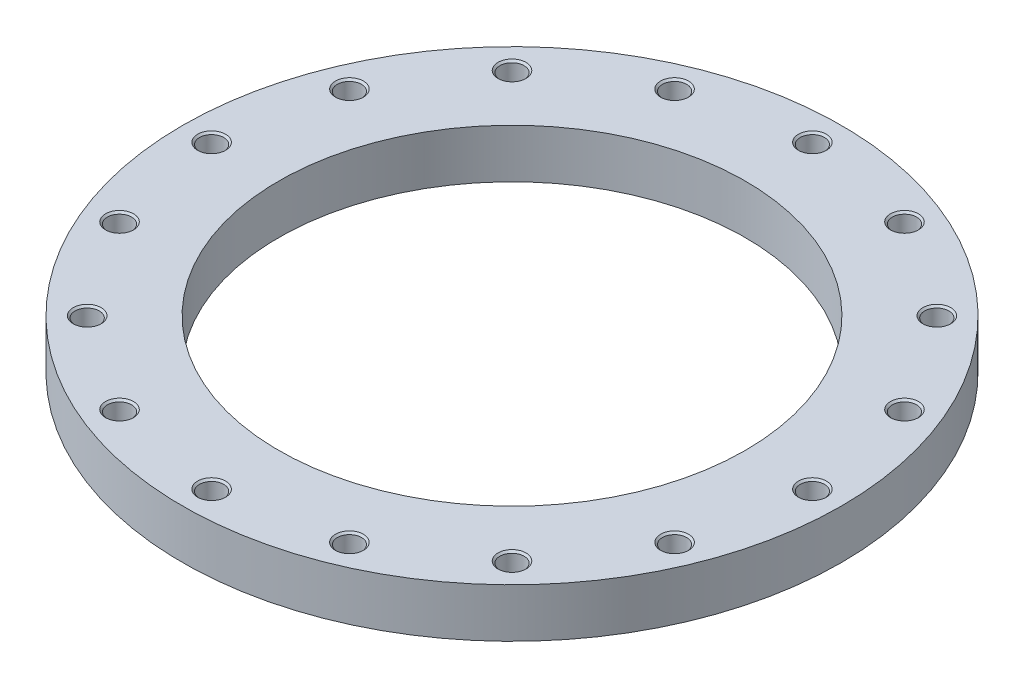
ISO-10303-21;
HEADER;
FILE_DESCRIPTION(('STEP AP214'),'2;1');
FILE_NAME('part.step','',(''),(''),'','','');
FILE_SCHEMA(('AUTOMOTIVE_DESIGN { 1 0 10303 214 1 1 1 1 }'));
ENDSEC;
DATA;
#1=APPLICATION_CONTEXT('core data for automotive mechanical design processes');
#2=APPLICATION_PROTOCOL_DEFINITION('international standard','automotive_design',2000,#1);
#3=PRODUCT_CONTEXT('',#1,'mechanical');
#4=PRODUCT('Part','Part','',(#3));
#5=PRODUCT_RELATED_PRODUCT_CATEGORY('part','',(#4));
#6=PRODUCT_DEFINITION_FORMATION('','',#4);
#7=PRODUCT_DEFINITION_CONTEXT('part definition',#1,'design');
#8=PRODUCT_DEFINITION('design','',#6,#7);
#9=PRODUCT_DEFINITION_SHAPE('','',#8);
#10=(LENGTH_UNIT() NAMED_UNIT(*) SI_UNIT(.MILLI.,.METRE.));
#11=(NAMED_UNIT(*) PLANE_ANGLE_UNIT() SI_UNIT($,.RADIAN.));
#12=(NAMED_UNIT(*) SI_UNIT($,.STERADIAN.) SOLID_ANGLE_UNIT());
#13=UNCERTAINTY_MEASURE_WITH_UNIT(LENGTH_MEASURE(1.E-05),#10,'distance_accuracy_value','');
#14=(GEOMETRIC_REPRESENTATION_CONTEXT(3) GLOBAL_UNCERTAINTY_ASSIGNED_CONTEXT((#13)) GLOBAL_UNIT_ASSIGNED_CONTEXT((#10,
#11,#12)) REPRESENTATION_CONTEXT('',''));
#15=CARTESIAN_POINT('',(0.,0.,0.));
#16=DIRECTION('',(0.,0.,1.));
#17=DIRECTION('',(1.,0.,0.));
#18=AXIS2_PLACEMENT_3D('',#15,#16,#17);
#19=CARTESIAN_POINT('',(0.,21.,0.));
#20=DIRECTION('',(0.,-1.,0.));
#21=DIRECTION('',(1.,0.,0.));
#22=AXIS2_PLACEMENT_3D('',#19,#20,#21);
#23=CYLINDRICAL_SURFACE('',#22,282.5);
#24=CARTESIAN_POINT('',(0.,0.,0.));
#25=DIRECTION('',(0.,1.,0.));
#26=DIRECTION('',(1.,0.,0.));
#27=AXIS2_PLACEMENT_3D('',#24,#25,#26);
#28=CIRCLE('',#27,282.5);
#29=CARTESIAN_POINT('',(282.5,0.,0.));
#30=VERTEX_POINT('',#29);
#31=EDGE_CURVE('E9',#30,#30,#28,.T.);
#32=ORIENTED_EDGE('',*,*,#31,.T.);
#33=EDGE_LOOP('',(#32));
#34=FACE_BOUND('',#33,.T.);
#35=CARTESIAN_POINT('',(0.,42.,0.));
#36=DIRECTION('',(0.,1.,0.));
#37=DIRECTION('',(1.,0.,0.));
#38=AXIS2_PLACEMENT_3D('',#35,#36,#37);
#39=CIRCLE('',#38,282.5);
#40=CARTESIAN_POINT('',(282.5,42.,0.));
#41=VERTEX_POINT('',#40);
#42=EDGE_CURVE('E18',#41,#41,#39,.T.);
#43=ORIENTED_EDGE('',*,*,#42,.F.);
#44=EDGE_LOOP('',(#43));
#45=FACE_BOUND('',#44,.T.);
#46=ADVANCED_FACE('F15',(#34,#45),#23,.T.);
#47=CARTESIAN_POINT('',(241.25,0.,0.));
#48=DIRECTION('',(0.,-1.,0.));
#49=DIRECTION('',(-1.,0.,0.));
#50=AXIS2_PLACEMENT_3D('',#47,#48,#49);
#51=PLANE('',#50);
#52=CARTESIAN_POINT('',(0.,0.,0.));
#53=DIRECTION('',(0.,1.,0.));
#54=DIRECTION('',(1.,0.,0.));
#55=AXIS2_PLACEMENT_3D('',#52,#53,#54);
#56=CIRCLE('',#55,200.);
#57=CARTESIAN_POINT('',(200.,0.,0.));
#58=VERTEX_POINT('',#57);
#59=EDGE_CURVE('E24',#58,#58,#56,.T.);
#60=ORIENTED_EDGE('',*,*,#59,.T.);
#61=EDGE_LOOP('',(#60));
#62=FACE_BOUND('',#61,.T.);
#63=ORIENTED_EDGE('',*,*,#31,.F.);
#64=EDGE_LOOP('',(#63));
#65=FACE_BOUND('',#64,.T.);
#66=ADVANCED_FACE('F390',(#62,#65),#51,.T.);
#67=CARTESIAN_POINT('',(0.,21.,0.));
#68=DIRECTION('',(0.,-1.,0.));
#69=DIRECTION('',(1.,0.,0.));
#70=AXIS2_PLACEMENT_3D('',#67,#68,#69);
#71=CYLINDRICAL_SURFACE('',#70,200.);
#72=CARTESIAN_POINT('',(0.,42.,0.));
#73=DIRECTION('',(0.,1.,0.));
#74=DIRECTION('',(1.,0.,0.));
#75=AXIS2_PLACEMENT_3D('',#72,#73,#74);
#76=CIRCLE('',#75,200.);
#77=CARTESIAN_POINT('',(200.,42.,0.));
#78=VERTEX_POINT('',#77);
#79=EDGE_CURVE('E400',#78,#78,#76,.T.);
#80=ORIENTED_EDGE('',*,*,#79,.T.);
#81=EDGE_LOOP('',(#80));
#82=FACE_BOUND('',#81,.T.);
#83=ORIENTED_EDGE('',*,*,#59,.F.);
#84=EDGE_LOOP('',(#83));
#85=FACE_BOUND('',#84,.T.);
#86=ADVANCED_FACE('F394',(#82,#85),#71,.F.);
#87=CARTESIAN_POINT('',(241.25,42.,0.));
#88=DIRECTION('',(0.,1.,0.));
#89=DIRECTION('',(1.,0.,0.));
#90=AXIS2_PLACEMENT_3D('',#87,#88,#89);
#91=PLANE('',#90);
#92=ORIENTED_EDGE('',*,*,#42,.T.);
#93=EDGE_LOOP('',(#92));
#94=FACE_BOUND('',#93,.T.);
#95=ORIENTED_EDGE('',*,*,#79,.F.);
#96=EDGE_LOOP('',(#95));
#97=FACE_BOUND('',#96,.T.);
#98=CARTESIAN_POINT('',(257.5,42.,0.));
#99=DIRECTION('',(0.,-1.,0.));
#100=DIRECTION('',(1.,0.,0.));
#101=AXIS2_PLACEMENT_3D('',#98,#99,#100);
#102=CIRCLE('',#101,12.);
#103=CARTESIAN_POINT('',(269.5,42.,0.));
#104=VERTEX_POINT('',#103);
#105=EDGE_CURVE('E413',#104,#104,#102,.T.);
#106=ORIENTED_EDGE('',*,*,#105,.T.);
#107=EDGE_LOOP('',(#106));
#108=FACE_BOUND('',#107,.T.);
#109=CARTESIAN_POINT('',(237.898979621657,42.,-98.5409838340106));
#110=DIRECTION('',(0.,-1.,0.));
#111=DIRECTION('',(0.923879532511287,0.,-0.38268343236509));
#112=AXIS2_PLACEMENT_3D('',#109,#110,#111);
#113=CIRCLE('',#112,12.);
#114=CARTESIAN_POINT('',(248.985534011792,42.,-103.133185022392));
#115=VERTEX_POINT('',#114);
#116=EDGE_CURVE('E422',#115,#115,#113,.T.);
#117=ORIENTED_EDGE('',*,*,#116,.T.);
#118=EDGE_LOOP('',(#117));
#119=FACE_BOUND('',#118,.T.);
#120=CARTESIAN_POINT('',(182.079996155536,42.,-182.079996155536));
#121=DIRECTION('',(0.,-1.,0.));
#122=DIRECTION('',(0.707106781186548,0.,-0.707106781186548));
#123=AXIS2_PLACEMENT_3D('',#120,#121,#122);
#124=CIRCLE('',#123,12.);
#125=CARTESIAN_POINT('',(190.565277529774,42.,-190.565277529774));
#126=VERTEX_POINT('',#125);
#127=EDGE_CURVE('E482',#126,#126,#124,.T.);
#128=ORIENTED_EDGE('',*,*,#127,.T.);
#129=EDGE_LOOP('',(#128));
#130=FACE_BOUND('',#129,.T.);
#131=CARTESIAN_POINT('',(98.5409838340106,42.,-237.898979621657));
#132=DIRECTION('',(0.,-1.,0.));
#133=DIRECTION('',(0.38268343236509,0.,-0.923879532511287));
#134=AXIS2_PLACEMENT_3D('',#131,#132,#133);
#135=CIRCLE('',#134,12.);
#136=CARTESIAN_POINT('',(103.133185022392,42.,-248.985534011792));
#137=VERTEX_POINT('',#136);
#138=EDGE_CURVE('E437',#137,#137,#135,.T.);
#139=ORIENTED_EDGE('',*,*,#138,.T.);
#140=EDGE_LOOP('',(#139));
#141=FACE_BOUND('',#140,.T.);
#142=CARTESIAN_POINT('',(0.,42.,-257.5));
#143=DIRECTION('',(0.,-1.,0.));
#144=DIRECTION('',(0.,0.,-1.));
#145=AXIS2_PLACEMENT_3D('',#142,#143,#144);
#146=CIRCLE('',#145,12.);
#147=CARTESIAN_POINT('',(0.,42.,-269.5));
#148=VERTEX_POINT('',#147);
#149=EDGE_CURVE('E446',#148,#148,#146,.T.);
#150=ORIENTED_EDGE('',*,*,#149,.T.);
#151=EDGE_LOOP('',(#150));
#152=FACE_BOUND('',#151,.T.);
#153=CARTESIAN_POINT('',(-98.5409838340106,42.,-237.898979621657));
#154=DIRECTION('',(0.,-1.,0.));
#155=DIRECTION('',(-0.38268343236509,0.,-0.923879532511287));
#156=AXIS2_PLACEMENT_3D('',#153,#154,#155);
#157=CIRCLE('',#156,12.);
#158=CARTESIAN_POINT('',(-103.133185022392,42.,-248.985534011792));
#159=VERTEX_POINT('',#158);
#160=EDGE_CURVE('E455',#159,#159,#157,.T.);
#161=ORIENTED_EDGE('',*,*,#160,.T.);
#162=EDGE_LOOP('',(#161));
#163=FACE_BOUND('',#162,.T.);
#164=CARTESIAN_POINT('',(-182.079996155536,42.,-182.079996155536));
#165=DIRECTION('',(0.,-1.,0.));
#166=DIRECTION('',(-0.707106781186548,0.,-0.707106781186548));
#167=AXIS2_PLACEMENT_3D('',#164,#165,#166);
#168=CIRCLE('',#167,12.);
#169=CARTESIAN_POINT('',(-190.565277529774,42.,-190.565277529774));
#170=VERTEX_POINT('',#169);
#171=EDGE_CURVE('E468',#170,#170,#168,.T.);
#172=ORIENTED_EDGE('',*,*,#171,.T.);
#173=EDGE_LOOP('',(#172));
#174=FACE_BOUND('',#173,.T.);
#175=CARTESIAN_POINT('',(-237.898979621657,42.,-98.5409838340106));
#176=DIRECTION('',(0.,-1.,0.));
#177=DIRECTION('',(-0.923879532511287,0.,-0.38268343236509));
#178=AXIS2_PLACEMENT_3D('',#175,#176,#177);
#179=CIRCLE('',#178,12.);
#180=CARTESIAN_POINT('',(-248.985534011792,42.,-103.133185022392));
#181=VERTEX_POINT('',#180);
#182=EDGE_CURVE('E481',#181,#181,#179,.T.);
#183=ORIENTED_EDGE('',*,*,#182,.T.);
#184=EDGE_LOOP('',(#183));
#185=FACE_BOUND('',#184,.T.);
#186=CARTESIAN_POINT('',(-257.5,42.,0.));
#187=DIRECTION('',(0.,-1.,0.));
#188=DIRECTION('',(-1.,0.,0.));
#189=AXIS2_PLACEMENT_3D('',#186,#187,#188);
#190=CIRCLE('',#189,12.);
#191=CARTESIAN_POINT('',(-269.5,42.,0.));
#192=VERTEX_POINT('',#191);
#193=EDGE_CURVE('E499',#192,#192,#190,.T.);
#194=ORIENTED_EDGE('',*,*,#193,.T.);
#195=EDGE_LOOP('',(#194));
#196=FACE_BOUND('',#195,.T.);
#197=CARTESIAN_POINT('',(-237.898979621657,42.,98.5409838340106));
#198=DIRECTION('',(0.,-1.,0.));
#199=DIRECTION('',(-0.923879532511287,0.,0.38268343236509));
#200=AXIS2_PLACEMENT_3D('',#197,#198,#199);
#201=CIRCLE('',#200,12.);
#202=CARTESIAN_POINT('',(-248.985534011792,42.,103.133185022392));
#203=VERTEX_POINT('',#202);
#204=EDGE_CURVE('E510',#203,#203,#201,.T.);
#205=ORIENTED_EDGE('',*,*,#204,.T.);
#206=EDGE_LOOP('',(#205));
#207=FACE_BOUND('',#206,.T.);
#208=CARTESIAN_POINT('',(-182.079996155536,42.,182.079996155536));
#209=DIRECTION('',(0.,-1.,0.));
#210=DIRECTION('',(-0.707106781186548,0.,0.707106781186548));
#211=AXIS2_PLACEMENT_3D('',#208,#209,#210);
#212=CIRCLE('',#211,12.);
#213=CARTESIAN_POINT('',(-190.565277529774,42.,190.565277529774));
#214=VERTEX_POINT('',#213);
#215=EDGE_CURVE('E520',#214,#214,#212,.T.);
#216=ORIENTED_EDGE('',*,*,#215,.T.);
#217=EDGE_LOOP('',(#216));
#218=FACE_BOUND('',#217,.T.);
#219=CARTESIAN_POINT('',(-98.5409838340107,42.,237.898979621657));
#220=DIRECTION('',(0.,-1.,0.));
#221=DIRECTION('',(-0.382683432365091,0.,0.923879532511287));
#222=AXIS2_PLACEMENT_3D('',#219,#220,#221);
#223=CIRCLE('',#222,12.);
#224=CARTESIAN_POINT('',(-103.133185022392,42.,248.985534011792));
#225=VERTEX_POINT('',#224);
#226=EDGE_CURVE('E532',#225,#225,#223,.T.);
#227=ORIENTED_EDGE('',*,*,#226,.T.);
#228=EDGE_LOOP('',(#227));
#229=FACE_BOUND('',#228,.T.);
#230=CARTESIAN_POINT('',(0.,42.,257.5));
#231=DIRECTION('',(0.,-1.,0.));
#232=DIRECTION('',(0.,0.,1.));
#233=AXIS2_PLACEMENT_3D('',#230,#231,#232);
#234=CIRCLE('',#233,12.);
#235=CARTESIAN_POINT('',(0.,42.,269.5));
#236=VERTEX_POINT('',#235);
#237=EDGE_CURVE('E549',#236,#236,#234,.T.);
#238=ORIENTED_EDGE('',*,*,#237,.T.);
#239=EDGE_LOOP('',(#238));
#240=FACE_BOUND('',#239,.T.);
#241=CARTESIAN_POINT('',(98.5409838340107,42.,237.898979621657));
#242=DIRECTION('',(0.,-1.,0.));
#243=DIRECTION('',(0.38268343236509,0.,0.923879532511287));
#244=AXIS2_PLACEMENT_3D('',#241,#242,#243);
#245=CIRCLE('',#244,12.);
#246=CARTESIAN_POINT('',(103.133185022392,42.,248.985534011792));
#247=VERTEX_POINT('',#246);
#248=EDGE_CURVE('E563',#247,#247,#245,.T.);
#249=ORIENTED_EDGE('',*,*,#248,.T.);
#250=EDGE_LOOP('',(#249));
#251=FACE_BOUND('',#250,.T.);
#252=CARTESIAN_POINT('',(182.079996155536,42.,182.079996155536));
#253=DIRECTION('',(0.,-1.,0.));
#254=DIRECTION('',(0.707106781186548,0.,0.707106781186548));
#255=AXIS2_PLACEMENT_3D('',#252,#253,#254);
#256=CIRCLE('',#255,12.);
#257=CARTESIAN_POINT('',(190.565277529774,42.,190.565277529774));
#258=VERTEX_POINT('',#257);
#259=EDGE_CURVE('E573',#258,#258,#256,.T.);
#260=ORIENTED_EDGE('',*,*,#259,.T.);
#261=EDGE_LOOP('',(#260));
#262=FACE_BOUND('',#261,.T.);
#263=CARTESIAN_POINT('',(237.898979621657,42.,98.5409838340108));
#264=DIRECTION('',(0.,-1.,0.));
#265=DIRECTION('',(0.923879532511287,0.,0.382683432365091));
#266=AXIS2_PLACEMENT_3D('',#263,#264,#265);
#267=CIRCLE('',#266,12.);
#268=CARTESIAN_POINT('',(248.985534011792,42.,103.133185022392));
#269=VERTEX_POINT('',#268);
#270=EDGE_CURVE('E583',#269,#269,#267,.T.);
#271=ORIENTED_EDGE('',*,*,#270,.T.);
#272=EDGE_LOOP('',(#271));
#273=FACE_BOUND('',#272,.T.);
#274=ADVANCED_FACE('F601',(#94,#97,#108,#119,#130,#141,#152,#163,#174,#185,#196,#207,#218,#229,
#240,#251,#262,#273),#91,.T.);
#275=CARTESIAN_POINT('',(257.5,6.00463463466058,0.));
#276=DIRECTION('',(0.,1.,0.));
#277=DIRECTION('',(1.,0.,0.));
#278=AXIS2_PLACEMENT_3D('',#275,#276,#277);
#279=CONICAL_SURFACE('',#278,5.188125,1.0471975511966);
#280=CARTESIAN_POINT('',(257.5,9.,0.));
#281=DIRECTION('',(0.,-1.,0.));
#282=DIRECTION('',(1.,0.,0.));
#283=AXIS2_PLACEMENT_3D('',#280,#281,#282);
#284=CIRCLE('',#283,10.37625);
#285=CARTESIAN_POINT('',(267.87625,9.,0.));
#286=VERTEX_POINT('',#285);
#287=EDGE_CURVE('E403',#286,#286,#284,.T.);
#288=ORIENTED_EDGE('',*,*,#287,.F.);
#289=EDGE_LOOP('',(#288));
#290=FACE_BOUND('',#289,.T.);
#291=CARTESIAN_POINT('',(257.5,3.00926926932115,0.));
#292=VERTEX_POINT('',#291);
#293=VERTEX_LOOP('',#292);
#294=FACE_BOUND('',#293,.T.);
#295=ADVANCED_FACE('F651',(#290,#294),#279,.F.);
#296=CARTESIAN_POINT('',(257.5,12.688125,0.));
#297=DIRECTION('',(0.,1.,0.));
#298=DIRECTION('',(1.,0.,0.));
#299=AXIS2_PLACEMENT_3D('',#296,#297,#298);
#300=CYLINDRICAL_SURFACE('',#299,10.37625);
#301=CARTESIAN_POINT('',(257.5,16.37625,0.));
#302=DIRECTION('',(0.,-1.,0.));
#303=DIRECTION('',(1.,0.,0.));
#304=AXIS2_PLACEMENT_3D('',#301,#302,#303);
#305=CIRCLE('',#304,10.37625);
#306=CARTESIAN_POINT('',(267.87625,16.37625,0.));
#307=VERTEX_POINT('',#306);
#308=EDGE_CURVE('E406',#307,#307,#305,.T.);
#309=ORIENTED_EDGE('',*,*,#308,.F.);
#310=EDGE_LOOP('',(#309));
#311=FACE_BOUND('',#310,.T.);
#312=ORIENTED_EDGE('',*,*,#287,.T.);
#313=EDGE_LOOP('',(#312));
#314=FACE_BOUND('',#313,.T.);
#315=ADVANCED_FACE('F654',(#311,#314),#300,.F.);
#316=CARTESIAN_POINT('',(257.5,17.188125,0.));
#317=DIRECTION('',(0.,1.,0.));
#318=DIRECTION('',(1.,0.,0.));
#319=AXIS2_PLACEMENT_3D('',#316,#317,#318);
#320=CONICAL_SURFACE('',#319,11.188125,0.785398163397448);
#321=CARTESIAN_POINT('',(257.5,18.,0.));
#322=DIRECTION('',(0.,-1.,0.));
#323=DIRECTION('',(1.,0.,0.));
#324=AXIS2_PLACEMENT_3D('',#321,#322,#323);
#325=CIRCLE('',#324,12.);
#326=CARTESIAN_POINT('',(269.5,18.,0.));
#327=VERTEX_POINT('',#326);
#328=EDGE_CURVE('E410',#327,#327,#325,.T.);
#329=ORIENTED_EDGE('',*,*,#328,.F.);
#330=EDGE_LOOP('',(#329));
#331=FACE_BOUND('',#330,.T.);
#332=ORIENTED_EDGE('',*,*,#308,.T.);
#333=EDGE_LOOP('',(#332));
#334=FACE_BOUND('',#333,.T.);
#335=ADVANCED_FACE('F696',(#331,#334),#320,.F.);
#336=CARTESIAN_POINT('',(268.688125,18.,0.));
#337=DIRECTION('',(0.,1.,0.));
#338=DIRECTION('',(-1.,0.,0.));
#339=AXIS2_PLACEMENT_3D('',#336,#337,#338);
#340=PLANE('',#339);
#341=CARTESIAN_POINT('',(257.5,18.,0.));
#342=DIRECTION('',(0.,-1.,0.));
#343=DIRECTION('',(1.,0.,0.));
#344=AXIS2_PLACEMENT_3D('',#341,#342,#343);
#345=CIRCLE('',#344,10.37625);
#346=CARTESIAN_POINT('',(267.87625,18.,0.));
#347=VERTEX_POINT('',#346);
#348=EDGE_CURVE('E411',#347,#347,#345,.T.);
#349=ORIENTED_EDGE('',*,*,#348,.F.);
#350=EDGE_LOOP('',(#349));
#351=FACE_BOUND('',#350,.T.);
#352=ORIENTED_EDGE('',*,*,#328,.T.);
#353=EDGE_LOOP('',(#352));
#354=FACE_BOUND('',#353,.T.);
#355=ADVANCED_FACE('F772',(#351,#354),#340,.F.);
#356=CARTESIAN_POINT('',(257.5,29.188125,0.));
#357=DIRECTION('',(0.,1.,0.));
#358=DIRECTION('',(1.,0.,0.));
#359=AXIS2_PLACEMENT_3D('',#356,#357,#358);
#360=CYLINDRICAL_SURFACE('',#359,10.37625);
#361=CARTESIAN_POINT('',(257.5,40.37625,0.));
#362=DIRECTION('',(0.,-1.,0.));
#363=DIRECTION('',(1.,0.,0.));
#364=AXIS2_PLACEMENT_3D('',#361,#362,#363);
#365=CIRCLE('',#364,10.37625);
#366=CARTESIAN_POINT('',(267.87625,40.37625,0.));
#367=VERTEX_POINT('',#366);
#368=EDGE_CURVE('E414',#367,#367,#365,.T.);
#369=ORIENTED_EDGE('',*,*,#368,.F.);
#370=EDGE_LOOP('',(#369));
#371=FACE_BOUND('',#370,.T.);
#372=ORIENTED_EDGE('',*,*,#348,.T.);
#373=EDGE_LOOP('',(#372));
#374=FACE_BOUND('',#373,.T.);
#375=ADVANCED_FACE('F768',(#371,#374),#360,.F.);
#376=CARTESIAN_POINT('',(257.5,41.188125,0.));
#377=DIRECTION('',(0.,1.,0.));
#378=DIRECTION('',(1.,0.,0.));
#379=AXIS2_PLACEMENT_3D('',#376,#377,#378);
#380=CONICAL_SURFACE('',#379,11.188125,0.785398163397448);
#381=ORIENTED_EDGE('',*,*,#105,.F.);
#382=EDGE_LOOP('',(#381));
#383=FACE_BOUND('',#382,.T.);
#384=ORIENTED_EDGE('',*,*,#368,.T.);
#385=EDGE_LOOP('',(#384));
#386=FACE_BOUND('',#385,.T.);
#387=ADVANCED_FACE('F771',(#383,#386),#380,.F.);
#388=CARTESIAN_POINT('',(237.898979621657,6.00463463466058,-98.5409838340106));
#389=DIRECTION('',(0.,1.,0.));
#390=DIRECTION('',(0.923879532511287,0.,-0.38268343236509));
#391=AXIS2_PLACEMENT_3D('',#388,#389,#390);
#392=CONICAL_SURFACE('',#391,5.188125,1.0471975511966);
#393=CARTESIAN_POINT('',(237.898979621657,9.,-98.5409838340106));
#394=DIRECTION('',(0.,-1.,0.));
#395=DIRECTION('',(0.923879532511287,0.,-0.38268343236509));
#396=AXIS2_PLACEMENT_3D('',#393,#394,#395);
#397=CIRCLE('',#396,10.37625);
#398=CARTESIAN_POINT('',(247.485384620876,9.,-102.511802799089));
#399=VERTEX_POINT('',#398);
#400=EDGE_CURVE('E416',#399,#399,#397,.T.);
#401=ORIENTED_EDGE('',*,*,#400,.F.);
#402=EDGE_LOOP('',(#401));
#403=FACE_BOUND('',#402,.T.);
#404=CARTESIAN_POINT('',(237.898979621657,3.00926926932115,-98.5409838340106));
#405=VERTEX_POINT('',#404);
#406=VERTEX_LOOP('',#405);
#407=FACE_BOUND('',#406,.T.);
#408=ADVANCED_FACE('F1385',(#403,#407),#392,.F.);
#409=CARTESIAN_POINT('',(237.898979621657,12.688125,-98.5409838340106));
#410=DIRECTION('',(0.,1.,0.));
#411=DIRECTION('',(0.923879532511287,0.,-0.38268343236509));
#412=AXIS2_PLACEMENT_3D('',#409,#410,#411);
#413=CYLINDRICAL_SURFACE('',#412,10.37625);
#414=CARTESIAN_POINT('',(237.898979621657,16.37625,-98.5409838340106));
#415=DIRECTION('',(0.,-1.,0.));
#416=DIRECTION('',(0.923879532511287,0.,-0.38268343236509));
#417=AXIS2_PLACEMENT_3D('',#414,#415,#416);
#418=CIRCLE('',#417,10.37625);
#419=CARTESIAN_POINT('',(247.485384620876,16.37625,-102.511802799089));
#420=VERTEX_POINT('',#419);
#421=EDGE_CURVE('E418',#420,#420,#418,.T.);
#422=ORIENTED_EDGE('',*,*,#421,.F.);
#423=EDGE_LOOP('',(#422));
#424=FACE_BOUND('',#423,.T.);
#425=ORIENTED_EDGE('',*,*,#400,.T.);
#426=EDGE_LOOP('',(#425));
#427=FACE_BOUND('',#426,.T.);
#428=ADVANCED_FACE('F1390',(#424,#427),#413,.F.);
#429=CARTESIAN_POINT('',(237.898979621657,17.188125,-98.5409838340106));
#430=DIRECTION('',(0.,1.,0.));
#431=DIRECTION('',(0.923879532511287,0.,-0.38268343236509));
#432=AXIS2_PLACEMENT_3D('',#429,#430,#431);
#433=CONICAL_SURFACE('',#432,11.188125,0.785398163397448);
#434=CARTESIAN_POINT('',(237.898979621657,18.,-98.5409838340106));
#435=DIRECTION('',(0.,-1.,0.));
#436=DIRECTION('',(0.923879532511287,0.,-0.38268343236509));
#437=AXIS2_PLACEMENT_3D('',#434,#435,#436);
#438=CIRCLE('',#437,12.);
#439=CARTESIAN_POINT('',(248.985534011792,18.,-103.133185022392));
#440=VERTEX_POINT('',#439);
#441=EDGE_CURVE('E421',#440,#440,#438,.T.);
#442=ORIENTED_EDGE('',*,*,#441,.F.);
#443=EDGE_LOOP('',(#442));
#444=FACE_BOUND('',#443,.T.);
#445=ORIENTED_EDGE('',*,*,#421,.T.);
#446=EDGE_LOOP('',(#445));
#447=FACE_BOUND('',#446,.T.);
#448=ADVANCED_FACE('F1387',(#444,#447),#433,.F.);
#449=CARTESIAN_POINT('',(248.235459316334,18.,-102.82249391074));
#450=DIRECTION('',(0.,1.,0.));
#451=DIRECTION('',(-0.923879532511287,0.,0.38268343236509));
#452=AXIS2_PLACEMENT_3D('',#449,#450,#451);
#453=PLANE('',#452);
#454=CARTESIAN_POINT('',(237.898979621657,18.,-98.5409838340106));
#455=DIRECTION('',(0.,-1.,0.));
#456=DIRECTION('',(0.923879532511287,0.,-0.38268343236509));
#457=AXIS2_PLACEMENT_3D('',#454,#455,#456);
#458=CIRCLE('',#457,10.37625);
#459=CARTESIAN_POINT('',(247.485384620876,18.,-102.511802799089));
#460=VERTEX_POINT('',#459);
#461=EDGE_CURVE('E419',#460,#460,#458,.T.);
#462=ORIENTED_EDGE('',*,*,#461,.F.);
#463=EDGE_LOOP('',(#462));
#464=FACE_BOUND('',#463,.T.);
#465=ORIENTED_EDGE('',*,*,#441,.T.);
#466=EDGE_LOOP('',(#465));
#467=FACE_BOUND('',#466,.T.);
#468=ADVANCED_FACE('F649',(#464,#467),#453,.F.);
#469=CARTESIAN_POINT('',(237.898979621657,29.188125,-98.5409838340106));
#470=DIRECTION('',(0.,1.,0.));
#471=DIRECTION('',(0.923879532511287,0.,-0.38268343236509));
#472=AXIS2_PLACEMENT_3D('',#469,#470,#471);
#473=CYLINDRICAL_SURFACE('',#472,10.37625);
#474=CARTESIAN_POINT('',(237.898979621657,40.37625,-98.5409838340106));
#475=DIRECTION('',(0.,-1.,0.));
#476=DIRECTION('',(0.923879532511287,0.,-0.38268343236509));
#477=AXIS2_PLACEMENT_3D('',#474,#475,#476);
#478=CIRCLE('',#477,10.37625);
#479=CARTESIAN_POINT('',(247.485384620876,40.37625,-102.511802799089));
#480=VERTEX_POINT('',#479);
#481=EDGE_CURVE('E423',#480,#480,#478,.T.);
#482=ORIENTED_EDGE('',*,*,#481,.F.);
#483=EDGE_LOOP('',(#482));
#484=FACE_BOUND('',#483,.T.);
#485=ORIENTED_EDGE('',*,*,#461,.T.);
#486=EDGE_LOOP('',(#485));
#487=FACE_BOUND('',#486,.T.);
#488=ADVANCED_FACE('F1392',(#484,#487),#473,.F.);
#489=CARTESIAN_POINT('',(237.898979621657,41.188125,-98.5409838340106));
#490=DIRECTION('',(0.,1.,0.));
#491=DIRECTION('',(0.923879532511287,0.,-0.38268343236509));
#492=AXIS2_PLACEMENT_3D('',#489,#490,#491);
#493=CONICAL_SURFACE('',#492,11.188125,0.785398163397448);
#494=ORIENTED_EDGE('',*,*,#116,.F.);
#495=EDGE_LOOP('',(#494));
#496=FACE_BOUND('',#495,.T.);
#497=ORIENTED_EDGE('',*,*,#481,.T.);
#498=EDGE_LOOP('',(#497));
#499=FACE_BOUND('',#498,.T.);
#500=ADVANCED_FACE('F688',(#496,#499),#493,.F.);
#501=CARTESIAN_POINT('',(182.079996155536,6.00463463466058,-182.079996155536));
#502=DIRECTION('',(0.,1.,0.));
#503=DIRECTION('',(0.707106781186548,0.,-0.707106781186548));
#504=AXIS2_PLACEMENT_3D('',#501,#502,#503);
#505=CONICAL_SURFACE('',#504,5.188125,1.0471975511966);
#506=CARTESIAN_POINT('',(182.079996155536,9.,-182.079996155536));
#507=DIRECTION('',(0.,-1.,0.));
#508=DIRECTION('',(0.707106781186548,0.,-0.707106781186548));
#509=AXIS2_PLACEMENT_3D('',#506,#507,#508);
#510=CIRCLE('',#509,10.37625);
#511=CARTESIAN_POINT('',(189.417112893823,9.,-189.417112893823));
#512=VERTEX_POINT('',#511);
#513=EDGE_CURVE('E425',#512,#512,#510,.T.);
#514=ORIENTED_EDGE('',*,*,#513,.F.);
#515=EDGE_LOOP('',(#514));
#516=FACE_BOUND('',#515,.T.);
#517=CARTESIAN_POINT('',(182.079996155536,3.00926926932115,-182.079996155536));
#518=VERTEX_POINT('',#517);
#519=VERTEX_LOOP('',#518);
#520=FACE_BOUND('',#519,.T.);
#521=ADVANCED_FACE('F685',(#516,#520),#505,.F.);
#522=CARTESIAN_POINT('',(182.079996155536,12.688125,-182.079996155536));
#523=DIRECTION('',(0.,1.,0.));
#524=DIRECTION('',(0.707106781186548,0.,-0.707106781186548));
#525=AXIS2_PLACEMENT_3D('',#522,#523,#524);
#526=CYLINDRICAL_SURFACE('',#525,10.37625);
#527=CARTESIAN_POINT('',(182.079996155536,16.37625,-182.079996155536));
#528=DIRECTION('',(0.,-1.,0.));
#529=DIRECTION('',(0.707106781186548,0.,-0.707106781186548));
#530=AXIS2_PLACEMENT_3D('',#527,#528,#529);
#531=CIRCLE('',#530,10.37625);
#532=CARTESIAN_POINT('',(189.417112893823,16.37625,-189.417112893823));
#533=VERTEX_POINT('',#532);
#534=EDGE_CURVE('E426',#533,#533,#531,.T.);
#535=ORIENTED_EDGE('',*,*,#534,.F.);
#536=EDGE_LOOP('',(#535));
#537=FACE_BOUND('',#536,.T.);
#538=ORIENTED_EDGE('',*,*,#513,.T.);
#539=EDGE_LOOP('',(#538));
#540=FACE_BOUND('',#539,.T.);
#541=ADVANCED_FACE('F678',(#537,#540),#526,.F.);
#542=CARTESIAN_POINT('',(182.079996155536,17.188125,-182.079996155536));
#543=DIRECTION('',(0.,1.,0.));
#544=DIRECTION('',(0.707106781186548,0.,-0.707106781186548));
#545=AXIS2_PLACEMENT_3D('',#542,#543,#544);
#546=CONICAL_SURFACE('',#545,11.188125,0.785398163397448);
#547=CARTESIAN_POINT('',(182.079996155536,18.,-182.079996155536));
#548=DIRECTION('',(0.,-1.,0.));
#549=DIRECTION('',(0.707106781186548,0.,-0.707106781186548));
#550=AXIS2_PLACEMENT_3D('',#547,#548,#549);
#551=CIRCLE('',#550,12.);
#552=CARTESIAN_POINT('',(190.565277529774,18.,-190.565277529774));
#553=VERTEX_POINT('',#552);
#554=EDGE_CURVE('E428',#553,#553,#551,.T.);
#555=ORIENTED_EDGE('',*,*,#554,.F.);
#556=EDGE_LOOP('',(#555));
#557=FACE_BOUND('',#556,.T.);
#558=ORIENTED_EDGE('',*,*,#534,.T.);
#559=EDGE_LOOP('',(#558));
#560=FACE_BOUND('',#559,.T.);
#561=ADVANCED_FACE('F675',(#557,#560),#546,.F.);
#562=CARTESIAN_POINT('',(189.991195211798,18.,-189.991195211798));
#563=DIRECTION('',(0.,1.,0.));
#564=DIRECTION('',(-0.707106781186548,0.,0.707106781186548));
#565=AXIS2_PLACEMENT_3D('',#562,#563,#564);
#566=PLANE('',#565);
#567=CARTESIAN_POINT('',(182.079996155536,18.,-182.079996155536));
#568=DIRECTION('',(0.,-1.,0.));
#569=DIRECTION('',(0.707106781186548,0.,-0.707106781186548));
#570=AXIS2_PLACEMENT_3D('',#567,#568,#569);
#571=CIRCLE('',#570,10.37625);
#572=CARTESIAN_POINT('',(189.417112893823,18.,-189.417112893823));
#573=VERTEX_POINT('',#572);
#574=EDGE_CURVE('E430',#573,#573,#571,.T.);
#575=ORIENTED_EDGE('',*,*,#574,.F.);
#576=EDGE_LOOP('',(#575));
#577=FACE_BOUND('',#576,.T.);
#578=ORIENTED_EDGE('',*,*,#554,.T.);
#579=EDGE_LOOP('',(#578));
#580=FACE_BOUND('',#579,.T.);
#581=ADVANCED_FACE('F677',(#577,#580),#566,.F.);
#582=CARTESIAN_POINT('',(182.079996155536,29.188125,-182.079996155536));
#583=DIRECTION('',(0.,1.,0.));
#584=DIRECTION('',(0.707106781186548,0.,-0.707106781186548));
#585=AXIS2_PLACEMENT_3D('',#582,#583,#584);
#586=CYLINDRICAL_SURFACE('',#585,10.37625);
#587=CARTESIAN_POINT('',(182.079996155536,40.37625,-182.079996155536));
#588=DIRECTION('',(0.,-1.,0.));
#589=DIRECTION('',(0.707106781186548,0.,-0.707106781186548));
#590=AXIS2_PLACEMENT_3D('',#587,#588,#589);
#591=CIRCLE('',#590,10.37625);
#592=CARTESIAN_POINT('',(189.417112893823,40.37625,-189.417112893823));
#593=VERTEX_POINT('',#592);
#594=EDGE_CURVE('E484',#593,#593,#591,.T.);
#595=ORIENTED_EDGE('',*,*,#594,.F.);
#596=EDGE_LOOP('',(#595));
#597=FACE_BOUND('',#596,.T.);
#598=ORIENTED_EDGE('',*,*,#574,.T.);
#599=EDGE_LOOP('',(#598));
#600=FACE_BOUND('',#599,.T.);
#601=ADVANCED_FACE('F827',(#597,#600),#586,.F.);
#602=CARTESIAN_POINT('',(182.079996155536,41.188125,-182.079996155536));
#603=DIRECTION('',(0.,1.,0.));
#604=DIRECTION('',(0.707106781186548,0.,-0.707106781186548));
#605=AXIS2_PLACEMENT_3D('',#602,#603,#604);
#606=CONICAL_SURFACE('',#605,11.188125,0.785398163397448);
#607=ORIENTED_EDGE('',*,*,#127,.F.);
#608=EDGE_LOOP('',(#607));
#609=FACE_BOUND('',#608,.T.);
#610=ORIENTED_EDGE('',*,*,#594,.T.);
#611=EDGE_LOOP('',(#610));
#612=FACE_BOUND('',#611,.T.);
#613=ADVANCED_FACE('F835',(#609,#612),#606,.F.);
#614=CARTESIAN_POINT('',(98.5409838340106,6.00463463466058,-237.898979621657));
#615=DIRECTION('',(0.,1.,0.));
#616=DIRECTION('',(0.38268343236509,0.,-0.923879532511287));
#617=AXIS2_PLACEMENT_3D('',#614,#615,#616);
#618=CONICAL_SURFACE('',#617,5.188125,1.0471975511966);
#619=CARTESIAN_POINT('',(98.5409838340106,9.,-237.898979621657));
#620=DIRECTION('',(0.,-1.,0.));
#621=DIRECTION('',(0.38268343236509,0.,-0.923879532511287));
#622=AXIS2_PLACEMENT_3D('',#619,#620,#621);
#623=CIRCLE('',#622,10.37625);
#624=CARTESIAN_POINT('',(102.511802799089,9.,-247.485384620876));
#625=VERTEX_POINT('',#624);
#626=EDGE_CURVE('E490',#625,#625,#623,.T.);
#627=ORIENTED_EDGE('',*,*,#626,.F.);
#628=EDGE_LOOP('',(#627));
#629=FACE_BOUND('',#628,.T.);
#630=CARTESIAN_POINT('',(98.5409838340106,3.00926926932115,-237.898979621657));
#631=VERTEX_POINT('',#630);
#632=VERTEX_LOOP('',#631);
#633=FACE_BOUND('',#632,.T.);
#634=ADVANCED_FACE('F843',(#629,#633),#618,.F.);
#635=CARTESIAN_POINT('',(98.5409838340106,12.688125,-237.898979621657));
#636=DIRECTION('',(0.,1.,0.));
#637=DIRECTION('',(0.38268343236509,0.,-0.923879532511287));
#638=AXIS2_PLACEMENT_3D('',#635,#636,#637);
#639=CYLINDRICAL_SURFACE('',#638,10.37625);
#640=CARTESIAN_POINT('',(98.5409838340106,16.37625,-237.898979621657));
#641=DIRECTION('',(0.,-1.,0.));
#642=DIRECTION('',(0.38268343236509,0.,-0.923879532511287));
#643=AXIS2_PLACEMENT_3D('',#640,#641,#642);
#644=CIRCLE('',#643,10.37625);
#645=CARTESIAN_POINT('',(102.511802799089,16.37625,-247.485384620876));
#646=VERTEX_POINT('',#645);
#647=EDGE_CURVE('E433',#646,#646,#644,.T.);
#648=ORIENTED_EDGE('',*,*,#647,.F.);
#649=EDGE_LOOP('',(#648));
#650=FACE_BOUND('',#649,.T.);
#651=ORIENTED_EDGE('',*,*,#626,.T.);
#652=EDGE_LOOP('',(#651));
#653=FACE_BOUND('',#652,.T.);
#654=ADVANCED_FACE('F670',(#650,#653),#639,.F.);
#655=CARTESIAN_POINT('',(98.5409838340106,17.188125,-237.898979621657));
#656=DIRECTION('',(0.,1.,0.));
#657=DIRECTION('',(0.38268343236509,0.,-0.923879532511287));
#658=AXIS2_PLACEMENT_3D('',#655,#656,#657);
#659=CONICAL_SURFACE('',#658,11.188125,0.785398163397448);
#660=CARTESIAN_POINT('',(98.5409838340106,18.,-237.898979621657));
#661=DIRECTION('',(0.,-1.,0.));
#662=DIRECTION('',(0.38268343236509,0.,-0.923879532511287));
#663=AXIS2_PLACEMENT_3D('',#660,#661,#662);
#664=CIRCLE('',#663,12.);
#665=CARTESIAN_POINT('',(103.133185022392,18.,-248.985534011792));
#666=VERTEX_POINT('',#665);
#667=EDGE_CURVE('E431',#666,#666,#664,.T.);
#668=ORIENTED_EDGE('',*,*,#667,.F.);
#669=EDGE_LOOP('',(#668));
#670=FACE_BOUND('',#669,.T.);
#671=ORIENTED_EDGE('',*,*,#647,.T.);
#672=EDGE_LOOP('',(#671));
#673=FACE_BOUND('',#672,.T.);
#674=ADVANCED_FACE('F666',(#670,#673),#659,.F.);
#675=CARTESIAN_POINT('',(102.82249391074,18.,-248.235459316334));
#676=DIRECTION('',(0.,1.,0.));
#677=DIRECTION('',(-0.38268343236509,0.,0.923879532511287));
#678=AXIS2_PLACEMENT_3D('',#675,#676,#677);
#679=PLANE('',#678);
#680=CARTESIAN_POINT('',(98.5409838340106,18.,-237.898979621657));
#681=DIRECTION('',(0.,-1.,0.));
#682=DIRECTION('',(0.38268343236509,0.,-0.923879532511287));
#683=AXIS2_PLACEMENT_3D('',#680,#681,#682);
#684=CIRCLE('',#683,10.37625);
#685=CARTESIAN_POINT('',(102.511802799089,18.,-247.485384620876));
#686=VERTEX_POINT('',#685);
#687=EDGE_CURVE('E434',#686,#686,#684,.T.);
#688=ORIENTED_EDGE('',*,*,#687,.F.);
#689=EDGE_LOOP('',(#688));
#690=FACE_BOUND('',#689,.T.);
#691=ORIENTED_EDGE('',*,*,#667,.T.);
#692=EDGE_LOOP('',(#691));
#693=FACE_BOUND('',#692,.T.);
#694=ADVANCED_FACE('F669',(#690,#693),#679,.F.);
#695=CARTESIAN_POINT('',(98.5409838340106,29.188125,-237.898979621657));
#696=DIRECTION('',(0.,1.,0.));
#697=DIRECTION('',(0.38268343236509,0.,-0.923879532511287));
#698=AXIS2_PLACEMENT_3D('',#695,#696,#697);
#699=CYLINDRICAL_SURFACE('',#698,10.37625);
#700=CARTESIAN_POINT('',(98.5409838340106,40.37625,-237.898979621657));
#701=DIRECTION('',(0.,-1.,0.));
#702=DIRECTION('',(0.38268343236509,0.,-0.923879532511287));
#703=AXIS2_PLACEMENT_3D('',#700,#701,#702);
#704=CIRCLE('',#703,10.37625);
#705=CARTESIAN_POINT('',(102.511802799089,40.37625,-247.485384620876));
#706=VERTEX_POINT('',#705);
#707=EDGE_CURVE('E435',#706,#706,#704,.T.);
#708=ORIENTED_EDGE('',*,*,#707,.F.);
#709=EDGE_LOOP('',(#708));
#710=FACE_BOUND('',#709,.T.);
#711=ORIENTED_EDGE('',*,*,#687,.T.);
#712=EDGE_LOOP('',(#711));
#713=FACE_BOUND('',#712,.T.);
#714=ADVANCED_FACE('F748',(#710,#713),#699,.F.);
#715=CARTESIAN_POINT('',(98.5409838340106,41.188125,-237.898979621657));
#716=DIRECTION('',(0.,1.,0.));
#717=DIRECTION('',(0.38268343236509,0.,-0.923879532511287));
#718=AXIS2_PLACEMENT_3D('',#715,#716,#717);
#719=CONICAL_SURFACE('',#718,11.188125,0.785398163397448);
#720=ORIENTED_EDGE('',*,*,#138,.F.);
#721=EDGE_LOOP('',(#720));
#722=FACE_BOUND('',#721,.T.);
#723=ORIENTED_EDGE('',*,*,#707,.T.);
#724=EDGE_LOOP('',(#723));
#725=FACE_BOUND('',#724,.T.);
#726=ADVANCED_FACE('F780',(#722,#725),#719,.F.);
#727=CARTESIAN_POINT('',(0.,6.00463463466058,-257.5));
#728=DIRECTION('',(0.,1.,0.));
#729=DIRECTION('',(0.,0.,-1.));
#730=AXIS2_PLACEMENT_3D('',#727,#728,#729);
#731=CONICAL_SURFACE('',#730,5.188125,1.0471975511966);
#732=CARTESIAN_POINT('',(0.,9.,-257.5));
#733=DIRECTION('',(0.,-1.,0.));
#734=DIRECTION('',(0.,0.,-1.));
#735=AXIS2_PLACEMENT_3D('',#732,#733,#734);
#736=CIRCLE('',#735,10.37625);
#737=CARTESIAN_POINT('',(0.,9.,-267.87625));
#738=VERTEX_POINT('',#737);
#739=EDGE_CURVE('E438',#738,#738,#736,.T.);
#740=ORIENTED_EDGE('',*,*,#739,.F.);
#741=EDGE_LOOP('',(#740));
#742=FACE_BOUND('',#741,.T.);
#743=CARTESIAN_POINT('',(0.,3.00926926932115,-257.5));
#744=VERTEX_POINT('',#743);
#745=VERTEX_LOOP('',#744);
#746=FACE_BOUND('',#745,.T.);
#747=ADVANCED_FACE('F876',(#742,#746),#731,.F.);
#748=CARTESIAN_POINT('',(0.,12.688125,-257.5));
#749=DIRECTION('',(0.,1.,0.));
#750=DIRECTION('',(0.,0.,-1.));
#751=AXIS2_PLACEMENT_3D('',#748,#749,#750);
#752=CYLINDRICAL_SURFACE('',#751,10.37625);
#753=CARTESIAN_POINT('',(0.,16.37625,-257.5));
#754=DIRECTION('',(0.,-1.,0.));
#755=DIRECTION('',(0.,0.,-1.));
#756=AXIS2_PLACEMENT_3D('',#753,#754,#755);
#757=CIRCLE('',#756,10.37625);
#758=CARTESIAN_POINT('',(0.,16.37625,-267.87625));
#759=VERTEX_POINT('',#758);
#760=EDGE_CURVE('E440',#759,#759,#757,.T.);
#761=ORIENTED_EDGE('',*,*,#760,.F.);
#762=EDGE_LOOP('',(#761));
#763=FACE_BOUND('',#762,.T.);
#764=ORIENTED_EDGE('',*,*,#739,.T.);
#765=EDGE_LOOP('',(#764));
#766=FACE_BOUND('',#765,.T.);
#767=ADVANCED_FACE('F722',(#763,#766),#752,.F.);
#768=CARTESIAN_POINT('',(0.,17.188125,-257.5));
#769=DIRECTION('',(0.,1.,0.));
#770=DIRECTION('',(0.,0.,-1.));
#771=AXIS2_PLACEMENT_3D('',#768,#769,#770);
#772=CONICAL_SURFACE('',#771,11.188125,0.785398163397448);
#773=CARTESIAN_POINT('',(0.,18.,-257.5));
#774=DIRECTION('',(0.,-1.,0.));
#775=DIRECTION('',(0.,0.,-1.));
#776=AXIS2_PLACEMENT_3D('',#773,#774,#775);
#777=CIRCLE('',#776,12.);
#778=CARTESIAN_POINT('',(0.,18.,-269.5));
#779=VERTEX_POINT('',#778);
#780=EDGE_CURVE('E442',#779,#779,#777,.T.);
#781=ORIENTED_EDGE('',*,*,#780,.F.);
#782=EDGE_LOOP('',(#781));
#783=FACE_BOUND('',#782,.T.);
#784=ORIENTED_EDGE('',*,*,#760,.T.);
#785=EDGE_LOOP('',(#784));
#786=FACE_BOUND('',#785,.T.);
#787=ADVANCED_FACE('F718',(#783,#786),#772,.F.);
#788=CARTESIAN_POINT('',(0.,18.,-268.688125));
#789=DIRECTION('',(0.,1.,0.));
#790=DIRECTION('',(0.,0.,1.));
#791=AXIS2_PLACEMENT_3D('',#788,#789,#790);
#792=PLANE('',#791);
#793=CARTESIAN_POINT('',(0.,18.,-257.5));
#794=DIRECTION('',(0.,-1.,0.));
#795=DIRECTION('',(0.,0.,-1.));
#796=AXIS2_PLACEMENT_3D('',#793,#794,#795);
#797=CIRCLE('',#796,10.37625);
#798=CARTESIAN_POINT('',(0.,18.,-267.87625));
#799=VERTEX_POINT('',#798);
#800=EDGE_CURVE('E444',#799,#799,#797,.T.);
#801=ORIENTED_EDGE('',*,*,#800,.F.);
#802=EDGE_LOOP('',(#801));
#803=FACE_BOUND('',#802,.T.);
#804=ORIENTED_EDGE('',*,*,#780,.T.);
#805=EDGE_LOOP('',(#804));
#806=FACE_BOUND('',#805,.T.);
#807=ADVANCED_FACE('F721',(#803,#806),#792,.F.);
#808=CARTESIAN_POINT('',(0.,29.188125,-257.5));
#809=DIRECTION('',(0.,1.,0.));
#810=DIRECTION('',(0.,0.,-1.));
#811=AXIS2_PLACEMENT_3D('',#808,#809,#810);
#812=CYLINDRICAL_SURFACE('',#811,10.37625);
#813=CARTESIAN_POINT('',(0.,40.37625,-257.5));
#814=DIRECTION('',(0.,-1.,0.));
#815=DIRECTION('',(0.,0.,-1.));
#816=AXIS2_PLACEMENT_3D('',#813,#814,#815);
#817=CIRCLE('',#816,10.37625);
#818=CARTESIAN_POINT('',(0.,40.37625,-267.87625));
#819=VERTEX_POINT('',#818);
#820=EDGE_CURVE('E449',#819,#819,#817,.T.);
#821=ORIENTED_EDGE('',*,*,#820,.F.);
#822=EDGE_LOOP('',(#821));
#823=FACE_BOUND('',#822,.T.);
#824=ORIENTED_EDGE('',*,*,#800,.T.);
#825=EDGE_LOOP('',(#824));
#826=FACE_BOUND('',#825,.T.);
#827=ADVANCED_FACE('F902',(#823,#826),#812,.F.);
#828=CARTESIAN_POINT('',(0.,41.188125,-257.5));
#829=DIRECTION('',(0.,1.,0.));
#830=DIRECTION('',(0.,0.,-1.));
#831=AXIS2_PLACEMENT_3D('',#828,#829,#830);
#832=CONICAL_SURFACE('',#831,11.188125,0.785398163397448);
#833=ORIENTED_EDGE('',*,*,#149,.F.);
#834=EDGE_LOOP('',(#833));
#835=FACE_BOUND('',#834,.T.);
#836=ORIENTED_EDGE('',*,*,#820,.T.);
#837=EDGE_LOOP('',(#836));
#838=FACE_BOUND('',#837,.T.);
#839=ADVANCED_FACE('F910',(#835,#838),#832,.F.);
#840=CARTESIAN_POINT('',(-98.5409838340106,6.00463463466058,-237.898979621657));
#841=DIRECTION('',(0.,1.,0.));
#842=DIRECTION('',(-0.38268343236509,0.,-0.923879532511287));
#843=AXIS2_PLACEMENT_3D('',#840,#841,#842);
#844=CONICAL_SURFACE('',#843,5.188125,1.0471975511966);
#845=CARTESIAN_POINT('',(-98.5409838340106,9.,-237.898979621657));
#846=DIRECTION('',(0.,-1.,0.));
#847=DIRECTION('',(-0.38268343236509,0.,-0.923879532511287));
#848=AXIS2_PLACEMENT_3D('',#845,#846,#847);
#849=CIRCLE('',#848,10.37625);
#850=CARTESIAN_POINT('',(-102.511802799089,9.,-247.485384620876));
#851=VERTEX_POINT('',#850);
#852=EDGE_CURVE('E447',#851,#851,#849,.T.);
#853=ORIENTED_EDGE('',*,*,#852,.F.);
#854=EDGE_LOOP('',(#853));
#855=FACE_BOUND('',#854,.T.);
#856=CARTESIAN_POINT('',(-98.5409838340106,3.00926926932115,-237.898979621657));
#857=VERTEX_POINT('',#856);
#858=VERTEX_LOOP('',#857);
#859=FACE_BOUND('',#858,.T.);
#860=ADVANCED_FACE('F918',(#855,#859),#844,.F.);
#861=CARTESIAN_POINT('',(-98.5409838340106,12.688125,-237.898979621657));
#862=DIRECTION('',(0.,1.,0.));
#863=DIRECTION('',(-0.38268343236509,0.,-0.923879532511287));
#864=AXIS2_PLACEMENT_3D('',#861,#862,#863);
#865=CYLINDRICAL_SURFACE('',#864,10.37625);
#866=CARTESIAN_POINT('',(-98.5409838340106,16.37625,-237.898979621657));
#867=DIRECTION('',(0.,-1.,0.));
#868=DIRECTION('',(-0.38268343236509,0.,-0.923879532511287));
#869=AXIS2_PLACEMENT_3D('',#866,#867,#868);
#870=CIRCLE('',#869,10.37625);
#871=CARTESIAN_POINT('',(-102.511802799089,16.37625,-247.485384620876));
#872=VERTEX_POINT('',#871);
#873=EDGE_CURVE('E450',#872,#872,#870,.T.);
#874=ORIENTED_EDGE('',*,*,#873,.F.);
#875=EDGE_LOOP('',(#874));
#876=FACE_BOUND('',#875,.T.);
#877=ORIENTED_EDGE('',*,*,#852,.T.);
#878=EDGE_LOOP('',(#877));
#879=FACE_BOUND('',#878,.T.);
#880=ADVANCED_FACE('F926',(#876,#879),#865,.F.);
#881=CARTESIAN_POINT('',(-98.5409838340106,17.188125,-237.898979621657));
#882=DIRECTION('',(0.,1.,0.));
#883=DIRECTION('',(-0.38268343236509,0.,-0.923879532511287));
#884=AXIS2_PLACEMENT_3D('',#881,#882,#883);
#885=CONICAL_SURFACE('',#884,11.188125,0.785398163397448);
#886=CARTESIAN_POINT('',(-98.5409838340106,18.,-237.898979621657));
#887=DIRECTION('',(0.,-1.,0.));
#888=DIRECTION('',(-0.38268343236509,0.,-0.923879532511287));
#889=AXIS2_PLACEMENT_3D('',#886,#887,#888);
#890=CIRCLE('',#889,12.);
#891=CARTESIAN_POINT('',(-103.133185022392,18.,-248.985534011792));
#892=VERTEX_POINT('',#891);
#893=EDGE_CURVE('E452',#892,#892,#890,.T.);
#894=ORIENTED_EDGE('',*,*,#893,.F.);
#895=EDGE_LOOP('',(#894));
#896=FACE_BOUND('',#895,.T.);
#897=ORIENTED_EDGE('',*,*,#873,.T.);
#898=EDGE_LOOP('',(#897));
#899=FACE_BOUND('',#898,.T.);
#900=ADVANCED_FACE('F934',(#896,#899),#885,.F.);
#901=CARTESIAN_POINT('',(-102.82249391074,18.,-248.235459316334));
#902=DIRECTION('',(0.,1.,0.));
#903=DIRECTION('',(0.38268343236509,0.,0.923879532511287));
#904=AXIS2_PLACEMENT_3D('',#901,#902,#903);
#905=PLANE('',#904);
#906=CARTESIAN_POINT('',(-98.5409838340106,18.,-237.898979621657));
#907=DIRECTION('',(0.,-1.,0.));
#908=DIRECTION('',(-0.38268343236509,0.,-0.923879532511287));
#909=AXIS2_PLACEMENT_3D('',#906,#907,#908);
#910=CIRCLE('',#909,10.37625);
#911=CARTESIAN_POINT('',(-102.511802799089,18.,-247.485384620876));
#912=VERTEX_POINT('',#911);
#913=EDGE_CURVE('E453',#912,#912,#910,.T.);
#914=ORIENTED_EDGE('',*,*,#913,.F.);
#915=EDGE_LOOP('',(#914));
#916=FACE_BOUND('',#915,.T.);
#917=ORIENTED_EDGE('',*,*,#893,.T.);
#918=EDGE_LOOP('',(#917));
#919=FACE_BOUND('',#918,.T.);
#920=ADVANCED_FACE('F942',(#916,#919),#905,.F.);
#921=CARTESIAN_POINT('',(-98.5409838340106,29.188125,-237.898979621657));
#922=DIRECTION('',(0.,1.,0.));
#923=DIRECTION('',(-0.38268343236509,0.,-0.923879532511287));
#924=AXIS2_PLACEMENT_3D('',#921,#922,#923);
#925=CYLINDRICAL_SURFACE('',#924,10.37625);
#926=CARTESIAN_POINT('',(-98.5409838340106,40.37625,-237.898979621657));
#927=DIRECTION('',(0.,-1.,0.));
#928=DIRECTION('',(-0.38268343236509,0.,-0.923879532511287));
#929=AXIS2_PLACEMENT_3D('',#926,#927,#928);
#930=CIRCLE('',#929,10.37625);
#931=CARTESIAN_POINT('',(-102.511802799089,40.37625,-247.485384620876));
#932=VERTEX_POINT('',#931);
#933=EDGE_CURVE('E457',#932,#932,#930,.T.);
#934=ORIENTED_EDGE('',*,*,#933,.F.);
#935=EDGE_LOOP('',(#934));
#936=FACE_BOUND('',#935,.T.);
#937=ORIENTED_EDGE('',*,*,#913,.T.);
#938=EDGE_LOOP('',(#937));
#939=FACE_BOUND('',#938,.T.);
#940=ADVANCED_FACE('F950',(#936,#939),#925,.F.);
#941=CARTESIAN_POINT('',(-98.5409838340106,41.188125,-237.898979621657));
#942=DIRECTION('',(0.,1.,0.));
#943=DIRECTION('',(-0.38268343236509,0.,-0.923879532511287));
#944=AXIS2_PLACEMENT_3D('',#941,#942,#943);
#945=CONICAL_SURFACE('',#944,11.188125,0.785398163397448);
#946=ORIENTED_EDGE('',*,*,#160,.F.);
#947=EDGE_LOOP('',(#946));
#948=FACE_BOUND('',#947,.T.);
#949=ORIENTED_EDGE('',*,*,#933,.T.);
#950=EDGE_LOOP('',(#949));
#951=FACE_BOUND('',#950,.T.);
#952=ADVANCED_FACE('F958',(#948,#951),#945,.F.);
#953=CARTESIAN_POINT('',(-182.079996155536,6.00463463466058,-182.079996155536));
#954=DIRECTION('',(0.,1.,0.));
#955=DIRECTION('',(-0.707106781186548,0.,-0.707106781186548));
#956=AXIS2_PLACEMENT_3D('',#953,#954,#955);
#957=CONICAL_SURFACE('',#956,5.188125,1.0471975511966);
#958=CARTESIAN_POINT('',(-182.079996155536,9.,-182.079996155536));
#959=DIRECTION('',(0.,-1.,0.));
#960=DIRECTION('',(-0.707106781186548,0.,-0.707106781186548));
#961=AXIS2_PLACEMENT_3D('',#958,#959,#960);
#962=CIRCLE('',#961,10.37625);
#963=CARTESIAN_POINT('',(-189.417112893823,9.,-189.417112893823));
#964=VERTEX_POINT('',#963);
#965=EDGE_CURVE('E459',#964,#964,#962,.T.);
#966=ORIENTED_EDGE('',*,*,#965,.F.);
#967=EDGE_LOOP('',(#966));
#968=FACE_BOUND('',#967,.T.);
#969=CARTESIAN_POINT('',(-182.079996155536,3.00926926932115,-182.079996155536));
#970=VERTEX_POINT('',#969);
#971=VERTEX_LOOP('',#970);
#972=FACE_BOUND('',#971,.T.);
#973=ADVANCED_FACE('F966',(#968,#972),#957,.F.);
#974=CARTESIAN_POINT('',(-182.079996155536,12.688125,-182.079996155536));
#975=DIRECTION('',(0.,1.,0.));
#976=DIRECTION('',(-0.707106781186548,0.,-0.707106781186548));
#977=AXIS2_PLACEMENT_3D('',#974,#975,#976);
#978=CYLINDRICAL_SURFACE('',#977,10.37625);
#979=CARTESIAN_POINT('',(-182.079996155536,16.37625,-182.079996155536));
#980=DIRECTION('',(0.,-1.,0.));
#981=DIRECTION('',(-0.707106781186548,0.,-0.707106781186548));
#982=AXIS2_PLACEMENT_3D('',#979,#980,#981);
#983=CIRCLE('',#982,10.37625);
#984=CARTESIAN_POINT('',(-189.417112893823,16.37625,-189.417112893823));
#985=VERTEX_POINT('',#984);
#986=EDGE_CURVE('E461',#985,#985,#983,.T.);
#987=ORIENTED_EDGE('',*,*,#986,.F.);
#988=EDGE_LOOP('',(#987));
#989=FACE_BOUND('',#988,.T.);
#990=ORIENTED_EDGE('',*,*,#965,.T.);
#991=EDGE_LOOP('',(#990));
#992=FACE_BOUND('',#991,.T.);
#993=ADVANCED_FACE('F974',(#989,#992),#978,.F.);
#994=CARTESIAN_POINT('',(-182.079996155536,17.188125,-182.079996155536));
#995=DIRECTION('',(0.,1.,0.));
#996=DIRECTION('',(-0.707106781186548,0.,-0.707106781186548));
#997=AXIS2_PLACEMENT_3D('',#994,#995,#996);
#998=CONICAL_SURFACE('',#997,11.188125,0.785398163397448);
#999=CARTESIAN_POINT('',(-182.079996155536,18.,-182.079996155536));
#1000=DIRECTION('',(0.,-1.,0.));
#1001=DIRECTION('',(-0.707106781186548,0.,-0.707106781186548));
#1002=AXIS2_PLACEMENT_3D('',#999,#1000,#1001);
#1003=CIRCLE('',#1002,12.);
#1004=CARTESIAN_POINT('',(-190.565277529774,18.,-190.565277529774));
#1005=VERTEX_POINT('',#1004);
#1006=EDGE_CURVE('E463',#1005,#1005,#1003,.T.);
#1007=ORIENTED_EDGE('',*,*,#1006,.F.);
#1008=EDGE_LOOP('',(#1007));
#1009=FACE_BOUND('',#1008,.T.);
#1010=ORIENTED_EDGE('',*,*,#986,.T.);
#1011=EDGE_LOOP('',(#1010));
#1012=FACE_BOUND('',#1011,.T.);
#1013=ADVANCED_FACE('F982',(#1009,#1012),#998,.F.);
#1014=CARTESIAN_POINT('',(-189.991195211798,18.,-189.991195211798));
#1015=DIRECTION('',(0.,1.,0.));
#1016=DIRECTION('',(0.707106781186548,0.,0.707106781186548));
#1017=AXIS2_PLACEMENT_3D('',#1014,#1015,#1016);
#1018=PLANE('',#1017);
#1019=CARTESIAN_POINT('',(-182.079996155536,18.,-182.079996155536));
#1020=DIRECTION('',(0.,-1.,0.));
#1021=DIRECTION('',(-0.707106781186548,0.,-0.707106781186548));
#1022=AXIS2_PLACEMENT_3D('',#1019,#1020,#1021);
#1023=CIRCLE('',#1022,10.37625);
#1024=CARTESIAN_POINT('',(-189.417112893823,18.,-189.417112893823));
#1025=VERTEX_POINT('',#1024);
#1026=EDGE_CURVE('E465',#1025,#1025,#1023,.T.);
#1027=ORIENTED_EDGE('',*,*,#1026,.F.);
#1028=EDGE_LOOP('',(#1027));
#1029=FACE_BOUND('',#1028,.T.);
#1030=ORIENTED_EDGE('',*,*,#1006,.T.);
#1031=EDGE_LOOP('',(#1030));
#1032=FACE_BOUND('',#1031,.T.);
#1033=ADVANCED_FACE('F990',(#1029,#1032),#1018,.F.);
#1034=CARTESIAN_POINT('',(-182.079996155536,29.188125,-182.079996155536));
#1035=DIRECTION('',(0.,1.,0.));
#1036=DIRECTION('',(-0.707106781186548,0.,-0.707106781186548));
#1037=AXIS2_PLACEMENT_3D('',#1034,#1035,#1036);
#1038=CYLINDRICAL_SURFACE('',#1037,10.37625);
#1039=CARTESIAN_POINT('',(-182.079996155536,40.37625,-182.079996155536));
#1040=DIRECTION('',(0.,-1.,0.));
#1041=DIRECTION('',(-0.707106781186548,0.,-0.707106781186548));
#1042=AXIS2_PLACEMENT_3D('',#1039,#1040,#1041);
#1043=CIRCLE('',#1042,10.37625);
#1044=CARTESIAN_POINT('',(-189.417112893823,40.37625,-189.417112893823));
#1045=VERTEX_POINT('',#1044);
#1046=EDGE_CURVE('E470',#1045,#1045,#1043,.T.);
#1047=ORIENTED_EDGE('',*,*,#1046,.F.);
#1048=EDGE_LOOP('',(#1047));
#1049=FACE_BOUND('',#1048,.T.);
#1050=ORIENTED_EDGE('',*,*,#1026,.T.);
#1051=EDGE_LOOP('',(#1050));
#1052=FACE_BOUND('',#1051,.T.);
#1053=ADVANCED_FACE('F998',(#1049,#1052),#1038,.F.);
#1054=CARTESIAN_POINT('',(-182.079996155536,41.188125,-182.079996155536));
#1055=DIRECTION('',(0.,1.,0.));
#1056=DIRECTION('',(-0.707106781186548,0.,-0.707106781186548));
#1057=AXIS2_PLACEMENT_3D('',#1054,#1055,#1056);
#1058=CONICAL_SURFACE('',#1057,11.188125,0.785398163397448);
#1059=ORIENTED_EDGE('',*,*,#171,.F.);
#1060=EDGE_LOOP('',(#1059));
#1061=FACE_BOUND('',#1060,.T.);
#1062=ORIENTED_EDGE('',*,*,#1046,.T.);
#1063=EDGE_LOOP('',(#1062));
#1064=FACE_BOUND('',#1063,.T.);
#1065=ADVANCED_FACE('F1006',(#1061,#1064),#1058,.F.);
#1066=CARTESIAN_POINT('',(-237.898979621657,6.00463463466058,-98.5409838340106));
#1067=DIRECTION('',(0.,1.,0.));
#1068=DIRECTION('',(-0.923879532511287,0.,-0.38268343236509));
#1069=AXIS2_PLACEMENT_3D('',#1066,#1067,#1068);
#1070=CONICAL_SURFACE('',#1069,5.188125,1.0471975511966);
#1071=CARTESIAN_POINT('',(-237.898979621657,9.,-98.5409838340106));
#1072=DIRECTION('',(0.,-1.,0.));
#1073=DIRECTION('',(-0.923879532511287,0.,-0.38268343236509));
#1074=AXIS2_PLACEMENT_3D('',#1071,#1072,#1073);
#1075=CIRCLE('',#1074,10.37625);
#1076=CARTESIAN_POINT('',(-247.485384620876,9.,-102.511802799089));
#1077=VERTEX_POINT('',#1076);
#1078=EDGE_CURVE('E473',#1077,#1077,#1075,.T.);
#1079=ORIENTED_EDGE('',*,*,#1078,.F.);
#1080=EDGE_LOOP('',(#1079));
#1081=FACE_BOUND('',#1080,.T.);
#1082=CARTESIAN_POINT('',(-237.898979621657,3.00926926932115,-98.5409838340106));
#1083=VERTEX_POINT('',#1082);
#1084=VERTEX_LOOP('',#1083);
#1085=FACE_BOUND('',#1084,.T.);
#1086=ADVANCED_FACE('F1014',(#1081,#1085),#1070,.F.);
#1087=CARTESIAN_POINT('',(-237.898979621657,12.688125,-98.5409838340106));
#1088=DIRECTION('',(0.,1.,0.));
#1089=DIRECTION('',(-0.923879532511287,0.,-0.38268343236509));
#1090=AXIS2_PLACEMENT_3D('',#1087,#1088,#1089);
#1091=CYLINDRICAL_SURFACE('',#1090,10.37625);
#1092=CARTESIAN_POINT('',(-237.898979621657,16.37625,-98.5409838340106));
#1093=DIRECTION('',(0.,-1.,0.));
#1094=DIRECTION('',(-0.923879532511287,0.,-0.38268343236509));
#1095=AXIS2_PLACEMENT_3D('',#1092,#1093,#1094);
#1096=CIRCLE('',#1095,10.37625);
#1097=CARTESIAN_POINT('',(-247.485384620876,16.37625,-102.511802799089));
#1098=VERTEX_POINT('',#1097);
#1099=EDGE_CURVE('E475',#1098,#1098,#1096,.T.);
#1100=ORIENTED_EDGE('',*,*,#1099,.F.);
#1101=EDGE_LOOP('',(#1100));
#1102=FACE_BOUND('',#1101,.T.);
#1103=ORIENTED_EDGE('',*,*,#1078,.T.);
#1104=EDGE_LOOP('',(#1103));
#1105=FACE_BOUND('',#1104,.T.);
#1106=ADVANCED_FACE('F1022',(#1102,#1105),#1091,.F.);
#1107=CARTESIAN_POINT('',(-237.898979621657,17.188125,-98.5409838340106));
#1108=DIRECTION('',(0.,1.,0.));
#1109=DIRECTION('',(-0.923879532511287,0.,-0.38268343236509));
#1110=AXIS2_PLACEMENT_3D('',#1107,#1108,#1109);
#1111=CONICAL_SURFACE('',#1110,11.188125,0.785398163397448);
#1112=CARTESIAN_POINT('',(-237.898979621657,18.,-98.5409838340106));
#1113=DIRECTION('',(0.,-1.,0.));
#1114=DIRECTION('',(-0.923879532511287,0.,-0.38268343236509));
#1115=AXIS2_PLACEMENT_3D('',#1112,#1113,#1114);
#1116=CIRCLE('',#1115,12.);
#1117=CARTESIAN_POINT('',(-248.985534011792,18.,-103.133185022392));
#1118=VERTEX_POINT('',#1117);
#1119=EDGE_CURVE('E477',#1118,#1118,#1116,.T.);
#1120=ORIENTED_EDGE('',*,*,#1119,.F.);
#1121=EDGE_LOOP('',(#1120));
#1122=FACE_BOUND('',#1121,.T.);
#1123=ORIENTED_EDGE('',*,*,#1099,.T.);
#1124=EDGE_LOOP('',(#1123));
#1125=FACE_BOUND('',#1124,.T.);
#1126=ADVANCED_FACE('F1030',(#1122,#1125),#1111,.F.);
#1127=CARTESIAN_POINT('',(-248.235459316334,18.,-102.82249391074));
#1128=DIRECTION('',(0.,1.,0.));
#1129=DIRECTION('',(0.923879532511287,0.,0.38268343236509));
#1130=AXIS2_PLACEMENT_3D('',#1127,#1128,#1129);
#1131=PLANE('',#1130);
#1132=CARTESIAN_POINT('',(-237.898979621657,18.,-98.5409838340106));
#1133=DIRECTION('',(0.,-1.,0.));
#1134=DIRECTION('',(-0.923879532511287,0.,-0.38268343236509));
#1135=AXIS2_PLACEMENT_3D('',#1132,#1133,#1134);
#1136=CIRCLE('',#1135,10.37625);
#1137=CARTESIAN_POINT('',(-247.485384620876,18.,-102.511802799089));
#1138=VERTEX_POINT('',#1137);
#1139=EDGE_CURVE('E479',#1138,#1138,#1136,.T.);
#1140=ORIENTED_EDGE('',*,*,#1139,.F.);
#1141=EDGE_LOOP('',(#1140));
#1142=FACE_BOUND('',#1141,.T.);
#1143=ORIENTED_EDGE('',*,*,#1119,.T.);
#1144=EDGE_LOOP('',(#1143));
#1145=FACE_BOUND('',#1144,.T.);
#1146=ADVANCED_FACE('F1038',(#1142,#1145),#1131,.F.);
#1147=CARTESIAN_POINT('',(-237.898979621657,29.188125,-98.5409838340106));
#1148=DIRECTION('',(0.,1.,0.));
#1149=DIRECTION('',(-0.923879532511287,0.,-0.38268343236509));
#1150=AXIS2_PLACEMENT_3D('',#1147,#1148,#1149);
#1151=CYLINDRICAL_SURFACE('',#1150,10.37625);
#1152=CARTESIAN_POINT('',(-237.898979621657,40.37625,-98.5409838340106));
#1153=DIRECTION('',(0.,-1.,0.));
#1154=DIRECTION('',(-0.923879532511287,0.,-0.38268343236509));
#1155=AXIS2_PLACEMENT_3D('',#1152,#1153,#1154);
#1156=CIRCLE('',#1155,10.37625);
#1157=CARTESIAN_POINT('',(-247.485384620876,40.37625,-102.511802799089));
#1158=VERTEX_POINT('',#1157);
#1159=EDGE_CURVE('E485',#1158,#1158,#1156,.T.);
#1160=ORIENTED_EDGE('',*,*,#1159,.F.);
#1161=EDGE_LOOP('',(#1160));
#1162=FACE_BOUND('',#1161,.T.);
#1163=ORIENTED_EDGE('',*,*,#1139,.T.);
#1164=EDGE_LOOP('',(#1163));
#1165=FACE_BOUND('',#1164,.T.);
#1166=ADVANCED_FACE('F1046',(#1162,#1165),#1151,.F.);
#1167=CARTESIAN_POINT('',(-237.898979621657,41.188125,-98.5409838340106));
#1168=DIRECTION('',(0.,1.,0.));
#1169=DIRECTION('',(-0.923879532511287,0.,-0.38268343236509));
#1170=AXIS2_PLACEMENT_3D('',#1167,#1168,#1169);
#1171=CONICAL_SURFACE('',#1170,11.188125,0.785398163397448);
#1172=ORIENTED_EDGE('',*,*,#182,.F.);
#1173=EDGE_LOOP('',(#1172));
#1174=FACE_BOUND('',#1173,.T.);
#1175=ORIENTED_EDGE('',*,*,#1159,.T.);
#1176=EDGE_LOOP('',(#1175));
#1177=FACE_BOUND('',#1176,.T.);
#1178=ADVANCED_FACE('F1054',(#1174,#1177),#1171,.F.);
#1179=CARTESIAN_POINT('',(-257.5,6.00463463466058,0.));
#1180=DIRECTION('',(0.,1.,0.));
#1181=DIRECTION('',(-1.,0.,0.));
#1182=AXIS2_PLACEMENT_3D('',#1179,#1180,#1181);
#1183=CONICAL_SURFACE('',#1182,5.188125,1.0471975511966);
#1184=CARTESIAN_POINT('',(-257.5,9.,0.));
#1185=DIRECTION('',(0.,-1.,0.));
#1186=DIRECTION('',(-1.,0.,0.));
#1187=AXIS2_PLACEMENT_3D('',#1184,#1185,#1186);
#1188=CIRCLE('',#1187,10.37625);
#1189=CARTESIAN_POINT('',(-267.87625,9.,0.));
#1190=VERTEX_POINT('',#1189);
#1191=EDGE_CURVE('E488',#1190,#1190,#1188,.T.);
#1192=ORIENTED_EDGE('',*,*,#1191,.F.);
#1193=EDGE_LOOP('',(#1192));
#1194=FACE_BOUND('',#1193,.T.);
#1195=CARTESIAN_POINT('',(-257.5,3.00926926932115,0.));
#1196=VERTEX_POINT('',#1195);
#1197=VERTEX_LOOP('',#1196);
#1198=FACE_BOUND('',#1197,.T.);
#1199=ADVANCED_FACE('F1062',(#1194,#1198),#1183,.F.);
#1200=CARTESIAN_POINT('',(-257.5,12.688125,0.));
#1201=DIRECTION('',(0.,1.,0.));
#1202=DIRECTION('',(-1.,0.,0.));
#1203=AXIS2_PLACEMENT_3D('',#1200,#1201,#1202);
#1204=CYLINDRICAL_SURFACE('',#1203,10.37625);
#1205=CARTESIAN_POINT('',(-257.5,16.37625,0.));
#1206=DIRECTION('',(0.,-1.,0.));
#1207=DIRECTION('',(-1.,0.,0.));
#1208=AXIS2_PLACEMENT_3D('',#1205,#1206,#1207);
#1209=CIRCLE('',#1208,10.37625);
#1210=CARTESIAN_POINT('',(-267.87625,16.37625,0.));
#1211=VERTEX_POINT('',#1210);
#1212=EDGE_CURVE('E492',#1211,#1211,#1209,.T.);
#1213=ORIENTED_EDGE('',*,*,#1212,.F.);
#1214=EDGE_LOOP('',(#1213));
#1215=FACE_BOUND('',#1214,.T.);
#1216=ORIENTED_EDGE('',*,*,#1191,.T.);
#1217=EDGE_LOOP('',(#1216));
#1218=FACE_BOUND('',#1217,.T.);
#1219=ADVANCED_FACE('F1070',(#1215,#1218),#1204,.F.);
#1220=CARTESIAN_POINT('',(-257.5,17.188125,0.));
#1221=DIRECTION('',(0.,1.,0.));
#1222=DIRECTION('',(-1.,0.,0.));
#1223=AXIS2_PLACEMENT_3D('',#1220,#1221,#1222);
#1224=CONICAL_SURFACE('',#1223,11.188125,0.785398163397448);
#1225=CARTESIAN_POINT('',(-257.5,18.,0.));
#1226=DIRECTION('',(0.,-1.,0.));
#1227=DIRECTION('',(-1.,0.,0.));
#1228=AXIS2_PLACEMENT_3D('',#1225,#1226,#1227);
#1229=CIRCLE('',#1228,12.);
#1230=CARTESIAN_POINT('',(-269.5,18.,0.));
#1231=VERTEX_POINT('',#1230);
#1232=EDGE_CURVE('E494',#1231,#1231,#1229,.T.);
#1233=ORIENTED_EDGE('',*,*,#1232,.F.);
#1234=EDGE_LOOP('',(#1233));
#1235=FACE_BOUND('',#1234,.T.);
#1236=ORIENTED_EDGE('',*,*,#1212,.T.);
#1237=EDGE_LOOP('',(#1236));
#1238=FACE_BOUND('',#1237,.T.);
#1239=ADVANCED_FACE('F1078',(#1235,#1238),#1224,.F.);
#1240=CARTESIAN_POINT('',(-268.688125,18.,0.));
#1241=DIRECTION('',(0.,1.,0.));
#1242=DIRECTION('',(1.,0.,0.));
#1243=AXIS2_PLACEMENT_3D('',#1240,#1241,#1242);
#1244=PLANE('',#1243);
#1245=CARTESIAN_POINT('',(-257.5,18.,0.));
#1246=DIRECTION('',(0.,-1.,0.));
#1247=DIRECTION('',(-1.,0.,0.));
#1248=AXIS2_PLACEMENT_3D('',#1245,#1246,#1247);
#1249=CIRCLE('',#1248,10.37625);
#1250=CARTESIAN_POINT('',(-267.87625,18.,0.));
#1251=VERTEX_POINT('',#1250);
#1252=EDGE_CURVE('E497',#1251,#1251,#1249,.T.);
#1253=ORIENTED_EDGE('',*,*,#1252,.F.);
#1254=EDGE_LOOP('',(#1253));
#1255=FACE_BOUND('',#1254,.T.);
#1256=ORIENTED_EDGE('',*,*,#1232,.T.);
#1257=EDGE_LOOP('',(#1256));
#1258=FACE_BOUND('',#1257,.T.);
#1259=ADVANCED_FACE('F762',(#1255,#1258),#1244,.F.);
#1260=CARTESIAN_POINT('',(-257.5,29.188125,0.));
#1261=DIRECTION('',(0.,1.,0.));
#1262=DIRECTION('',(-1.,0.,0.));
#1263=AXIS2_PLACEMENT_3D('',#1260,#1261,#1262);
#1264=CYLINDRICAL_SURFACE('',#1263,10.37625);
#1265=CARTESIAN_POINT('',(-257.5,40.37625,0.));
#1266=DIRECTION('',(0.,-1.,0.));
#1267=DIRECTION('',(-1.,0.,0.));
#1268=AXIS2_PLACEMENT_3D('',#1265,#1266,#1267);
#1269=CIRCLE('',#1268,10.37625);
#1270=CARTESIAN_POINT('',(-267.87625,40.37625,0.));
#1271=VERTEX_POINT('',#1270);
#1272=EDGE_CURVE('E503',#1271,#1271,#1269,.T.);
#1273=ORIENTED_EDGE('',*,*,#1272,.F.);
#1274=EDGE_LOOP('',(#1273));
#1275=FACE_BOUND('',#1274,.T.);
#1276=ORIENTED_EDGE('',*,*,#1252,.T.);
#1277=EDGE_LOOP('',(#1276));
#1278=FACE_BOUND('',#1277,.T.);
#1279=ADVANCED_FACE('F758',(#1275,#1278),#1264,.F.);
#1280=CARTESIAN_POINT('',(-257.5,41.188125,0.));
#1281=DIRECTION('',(0.,1.,0.));
#1282=DIRECTION('',(-1.,0.,0.));
#1283=AXIS2_PLACEMENT_3D('',#1280,#1281,#1282);
#1284=CONICAL_SURFACE('',#1283,11.188125,0.785398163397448);
#1285=ORIENTED_EDGE('',*,*,#193,.F.);
#1286=EDGE_LOOP('',(#1285));
#1287=FACE_BOUND('',#1286,.T.);
#1288=ORIENTED_EDGE('',*,*,#1272,.T.);
#1289=EDGE_LOOP('',(#1288));
#1290=FACE_BOUND('',#1289,.T.);
#1291=ADVANCED_FACE('F761',(#1287,#1290),#1284,.F.);
#1292=CARTESIAN_POINT('',(-237.898979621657,6.00463463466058,98.5409838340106));
#1293=DIRECTION('',(0.,1.,0.));
#1294=DIRECTION('',(-0.923879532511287,0.,0.38268343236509));
#1295=AXIS2_PLACEMENT_3D('',#1292,#1293,#1294);
#1296=CONICAL_SURFACE('',#1295,5.188125,1.0471975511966);
#1297=CARTESIAN_POINT('',(-237.898979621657,9.,98.5409838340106));
#1298=DIRECTION('',(0.,-1.,0.));
#1299=DIRECTION('',(-0.923879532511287,0.,0.38268343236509));
#1300=AXIS2_PLACEMENT_3D('',#1297,#1298,#1299);
#1301=CIRCLE('',#1300,10.37625);
#1302=CARTESIAN_POINT('',(-247.485384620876,9.,102.511802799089));
#1303=VERTEX_POINT('',#1302);
#1304=EDGE_CURVE('E501',#1303,#1303,#1301,.T.);
#1305=ORIENTED_EDGE('',*,*,#1304,.F.);
#1306=EDGE_LOOP('',(#1305));
#1307=FACE_BOUND('',#1306,.T.);
#1308=CARTESIAN_POINT('',(-237.898979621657,3.00926926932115,98.5409838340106));
#1309=VERTEX_POINT('',#1308);
#1310=VERTEX_LOOP('',#1309);
#1311=FACE_BOUND('',#1310,.T.);
#1312=ADVANCED_FACE('F1104',(#1307,#1311),#1296,.F.);
#1313=CARTESIAN_POINT('',(-237.898979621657,12.688125,98.5409838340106));
#1314=DIRECTION('',(0.,1.,0.));
#1315=DIRECTION('',(-0.923879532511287,0.,0.38268343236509));
#1316=AXIS2_PLACEMENT_3D('',#1313,#1314,#1315);
#1317=CYLINDRICAL_SURFACE('',#1316,10.37625);
#1318=CARTESIAN_POINT('',(-237.898979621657,16.37625,98.5409838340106));
#1319=DIRECTION('',(0.,-1.,0.));
#1320=DIRECTION('',(-0.923879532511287,0.,0.38268343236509));
#1321=AXIS2_PLACEMENT_3D('',#1318,#1319,#1320);
#1322=CIRCLE('',#1321,10.37625);
#1323=CARTESIAN_POINT('',(-247.485384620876,16.37625,102.511802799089));
#1324=VERTEX_POINT('',#1323);
#1325=EDGE_CURVE('E504',#1324,#1324,#1322,.T.);
#1326=ORIENTED_EDGE('',*,*,#1325,.F.);
#1327=EDGE_LOOP('',(#1326));
#1328=FACE_BOUND('',#1327,.T.);
#1329=ORIENTED_EDGE('',*,*,#1304,.T.);
#1330=EDGE_LOOP('',(#1329));
#1331=FACE_BOUND('',#1330,.T.);
#1332=ADVANCED_FACE('F728',(#1328,#1331),#1317,.F.);
#1333=CARTESIAN_POINT('',(-237.898979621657,17.188125,98.5409838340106));
#1334=DIRECTION('',(0.,1.,0.));
#1335=DIRECTION('',(-0.923879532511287,0.,0.38268343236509));
#1336=AXIS2_PLACEMENT_3D('',#1333,#1334,#1335);
#1337=CONICAL_SURFACE('',#1336,11.188125,0.785398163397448);
#1338=CARTESIAN_POINT('',(-237.898979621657,18.,98.5409838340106));
#1339=DIRECTION('',(0.,-1.,0.));
#1340=DIRECTION('',(-0.923879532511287,0.,0.38268343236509));
#1341=AXIS2_PLACEMENT_3D('',#1338,#1339,#1340);
#1342=CIRCLE('',#1341,12.);
#1343=CARTESIAN_POINT('',(-248.985534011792,18.,103.133185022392));
#1344=VERTEX_POINT('',#1343);
#1345=EDGE_CURVE('E506',#1344,#1344,#1342,.T.);
#1346=ORIENTED_EDGE('',*,*,#1345,.F.);
#1347=EDGE_LOOP('',(#1346));
#1348=FACE_BOUND('',#1347,.T.);
#1349=ORIENTED_EDGE('',*,*,#1325,.T.);
#1350=EDGE_LOOP('',(#1349));
#1351=FACE_BOUND('',#1350,.T.);
#1352=ADVANCED_FACE('F724',(#1348,#1351),#1337,.F.);
#1353=CARTESIAN_POINT('',(-248.235459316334,18.,102.82249391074));
#1354=DIRECTION('',(0.,1.,0.));
#1355=DIRECTION('',(0.923879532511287,0.,-0.38268343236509));
#1356=AXIS2_PLACEMENT_3D('',#1353,#1354,#1355);
#1357=PLANE('',#1356);
#1358=CARTESIAN_POINT('',(-237.898979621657,18.,98.5409838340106));
#1359=DIRECTION('',(0.,-1.,0.));
#1360=DIRECTION('',(-0.923879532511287,0.,0.38268343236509));
#1361=AXIS2_PLACEMENT_3D('',#1358,#1359,#1360);
#1362=CIRCLE('',#1361,10.37625);
#1363=CARTESIAN_POINT('',(-247.485384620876,18.,102.511802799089));
#1364=VERTEX_POINT('',#1363);
#1365=EDGE_CURVE('E509',#1364,#1364,#1362,.T.);
#1366=ORIENTED_EDGE('',*,*,#1365,.F.);
#1367=EDGE_LOOP('',(#1366));
#1368=FACE_BOUND('',#1367,.T.);
#1369=ORIENTED_EDGE('',*,*,#1345,.T.);
#1370=EDGE_LOOP('',(#1369));
#1371=FACE_BOUND('',#1370,.T.);
#1372=ADVANCED_FACE('F727',(#1368,#1371),#1357,.F.);
#1373=CARTESIAN_POINT('',(-237.898979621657,29.188125,98.5409838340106));
#1374=DIRECTION('',(0.,1.,0.));
#1375=DIRECTION('',(-0.923879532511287,0.,0.38268343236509));
#1376=AXIS2_PLACEMENT_3D('',#1373,#1374,#1375);
#1377=CYLINDRICAL_SURFACE('',#1376,10.37625);
#1378=CARTESIAN_POINT('',(-237.898979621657,40.37625,98.5409838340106));
#1379=DIRECTION('',(0.,-1.,0.));
#1380=DIRECTION('',(-0.923879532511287,0.,0.38268343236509));
#1381=AXIS2_PLACEMENT_3D('',#1378,#1379,#1380);
#1382=CIRCLE('',#1381,10.37625);
#1383=CARTESIAN_POINT('',(-247.485384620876,40.37625,102.511802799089));
#1384=VERTEX_POINT('',#1383);
#1385=EDGE_CURVE('E512',#1384,#1384,#1382,.T.);
#1386=ORIENTED_EDGE('',*,*,#1385,.F.);
#1387=EDGE_LOOP('',(#1386));
#1388=FACE_BOUND('',#1387,.T.);
#1389=ORIENTED_EDGE('',*,*,#1365,.T.);
#1390=EDGE_LOOP('',(#1389));
#1391=FACE_BOUND('',#1390,.T.);
#1392=ADVANCED_FACE('F383',(#1388,#1391),#1377,.F.);
#1393=CARTESIAN_POINT('',(-237.898979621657,41.188125,98.5409838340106));
#1394=DIRECTION('',(0.,1.,0.));
#1395=DIRECTION('',(-0.923879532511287,0.,0.38268343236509));
#1396=AXIS2_PLACEMENT_3D('',#1393,#1394,#1395);
#1397=CONICAL_SURFACE('',#1396,11.188125,0.785398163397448);
#1398=ORIENTED_EDGE('',*,*,#204,.F.);
#1399=EDGE_LOOP('',(#1398));
#1400=FACE_BOUND('',#1399,.T.);
#1401=ORIENTED_EDGE('',*,*,#1385,.T.);
#1402=EDGE_LOOP('',(#1401));
#1403=FACE_BOUND('',#1402,.T.);
#1404=ADVANCED_FACE('F372',(#1400,#1403),#1397,.F.);
#1405=CARTESIAN_POINT('',(-182.079996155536,6.00463463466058,182.079996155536));
#1406=DIRECTION('',(0.,1.,0.));
#1407=DIRECTION('',(-0.707106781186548,0.,0.707106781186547));
#1408=AXIS2_PLACEMENT_3D('',#1405,#1406,#1407);
#1409=CONICAL_SURFACE('',#1408,5.188125,1.0471975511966);
#1410=CARTESIAN_POINT('',(-182.079996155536,9.,182.079996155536));
#1411=DIRECTION('',(0.,-1.,0.));
#1412=DIRECTION('',(-0.707106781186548,0.,0.707106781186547));
#1413=AXIS2_PLACEMENT_3D('',#1410,#1411,#1412);
#1414=CIRCLE('',#1413,10.37625);
#1415=CARTESIAN_POINT('',(-189.417112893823,9.,189.417112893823));
#1416=VERTEX_POINT('',#1415);
#1417=EDGE_CURVE('E514',#1416,#1416,#1414,.T.);
#1418=ORIENTED_EDGE('',*,*,#1417,.F.);
#1419=EDGE_LOOP('',(#1418));
#1420=FACE_BOUND('',#1419,.T.);
#1421=CARTESIAN_POINT('',(-182.079996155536,3.00926926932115,182.079996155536));
#1422=VERTEX_POINT('',#1421);
#1423=VERTEX_LOOP('',#1422);
#1424=FACE_BOUND('',#1423,.T.);
#1425=ADVANCED_FACE('F369',(#1420,#1424),#1409,.F.);
#1426=CARTESIAN_POINT('',(-182.079996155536,12.688125,182.079996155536));
#1427=DIRECTION('',(0.,1.,0.));
#1428=DIRECTION('',(-0.707106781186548,0.,0.707106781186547));
#1429=AXIS2_PLACEMENT_3D('',#1426,#1427,#1428);
#1430=CYLINDRICAL_SURFACE('',#1429,10.37625);
#1431=CARTESIAN_POINT('',(-182.079996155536,16.37625,182.079996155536));
#1432=DIRECTION('',(0.,-1.,0.));
#1433=DIRECTION('',(-0.707106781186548,0.,0.707106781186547));
#1434=AXIS2_PLACEMENT_3D('',#1431,#1432,#1433);
#1435=CIRCLE('',#1434,10.37625);
#1436=CARTESIAN_POINT('',(-189.417112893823,16.37625,189.417112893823));
#1437=VERTEX_POINT('',#1436);
#1438=EDGE_CURVE('E516',#1437,#1437,#1435,.T.);
#1439=ORIENTED_EDGE('',*,*,#1438,.F.);
#1440=EDGE_LOOP('',(#1439));
#1441=FACE_BOUND('',#1440,.T.);
#1442=ORIENTED_EDGE('',*,*,#1417,.T.);
#1443=EDGE_LOOP('',(#1442));
#1444=FACE_BOUND('',#1443,.T.);
#1445=ADVANCED_FACE('F371',(#1441,#1444),#1430,.F.);
#1446=CARTESIAN_POINT('',(-182.079996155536,17.188125,182.079996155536));
#1447=DIRECTION('',(0.,1.,0.));
#1448=DIRECTION('',(-0.707106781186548,0.,0.707106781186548));
#1449=AXIS2_PLACEMENT_3D('',#1446,#1447,#1448);
#1450=CONICAL_SURFACE('',#1449,11.188125,0.785398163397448);
#1451=CARTESIAN_POINT('',(-182.079996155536,18.,182.079996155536));
#1452=DIRECTION('',(0.,-1.,0.));
#1453=DIRECTION('',(-0.707106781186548,0.,0.707106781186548));
#1454=AXIS2_PLACEMENT_3D('',#1451,#1452,#1453);
#1455=CIRCLE('',#1454,12.);
#1456=CARTESIAN_POINT('',(-190.565277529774,18.,190.565277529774));
#1457=VERTEX_POINT('',#1456);
#1458=EDGE_CURVE('E517',#1457,#1457,#1455,.T.);
#1459=ORIENTED_EDGE('',*,*,#1458,.F.);
#1460=EDGE_LOOP('',(#1459));
#1461=FACE_BOUND('',#1460,.T.);
#1462=ORIENTED_EDGE('',*,*,#1438,.T.);
#1463=EDGE_LOOP('',(#1462));
#1464=FACE_BOUND('',#1463,.T.);
#1465=ADVANCED_FACE('F380',(#1461,#1464),#1450,.F.);
#1466=CARTESIAN_POINT('',(-189.991195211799,18.,189.991195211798));
#1467=DIRECTION('',(0.,1.,0.));
#1468=DIRECTION('',(0.707106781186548,0.,-0.707106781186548));
#1469=AXIS2_PLACEMENT_3D('',#1466,#1467,#1468);
#1470=PLANE('',#1469);
#1471=CARTESIAN_POINT('',(-182.079996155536,18.,182.079996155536));
#1472=DIRECTION('',(0.,-1.,0.));
#1473=DIRECTION('',(-0.707106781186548,0.,0.707106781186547));
#1474=AXIS2_PLACEMENT_3D('',#1471,#1472,#1473);
#1475=CIRCLE('',#1474,10.37625);
#1476=CARTESIAN_POINT('',(-189.417112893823,18.,189.417112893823));
#1477=VERTEX_POINT('',#1476);
#1478=EDGE_CURVE('E519',#1477,#1477,#1475,.T.);
#1479=ORIENTED_EDGE('',*,*,#1478,.F.);
#1480=EDGE_LOOP('',(#1479));
#1481=FACE_BOUND('',#1480,.T.);
#1482=ORIENTED_EDGE('',*,*,#1458,.T.);
#1483=EDGE_LOOP('',(#1482));
#1484=FACE_BOUND('',#1483,.T.);
#1485=ADVANCED_FACE('F700',(#1481,#1484),#1470,.F.);
#1486=CARTESIAN_POINT('',(-182.079996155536,29.188125,182.079996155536));
#1487=DIRECTION('',(0.,1.,0.));
#1488=DIRECTION('',(-0.707106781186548,0.,0.707106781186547));
#1489=AXIS2_PLACEMENT_3D('',#1486,#1487,#1488);
#1490=CYLINDRICAL_SURFACE('',#1489,10.37625);
#1491=CARTESIAN_POINT('',(-182.079996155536,40.37625,182.079996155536));
#1492=DIRECTION('',(0.,-1.,0.));
#1493=DIRECTION('',(-0.707106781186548,0.,0.707106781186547));
#1494=AXIS2_PLACEMENT_3D('',#1491,#1492,#1493);
#1495=CIRCLE('',#1494,10.37625);
#1496=CARTESIAN_POINT('',(-189.417112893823,40.37625,189.417112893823));
#1497=VERTEX_POINT('',#1496);
#1498=EDGE_CURVE('E521',#1497,#1497,#1495,.T.);
#1499=ORIENTED_EDGE('',*,*,#1498,.F.);
#1500=EDGE_LOOP('',(#1499));
#1501=FACE_BOUND('',#1500,.T.);
#1502=ORIENTED_EDGE('',*,*,#1478,.T.);
#1503=EDGE_LOOP('',(#1502));
#1504=FACE_BOUND('',#1503,.T.);
#1505=ADVANCED_FACE('F796',(#1501,#1504),#1490,.F.);
#1506=CARTESIAN_POINT('',(-182.079996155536,41.188125,182.079996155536));
#1507=DIRECTION('',(0.,1.,0.));
#1508=DIRECTION('',(-0.707106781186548,0.,0.707106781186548));
#1509=AXIS2_PLACEMENT_3D('',#1506,#1507,#1508);
#1510=CONICAL_SURFACE('',#1509,11.188125,0.785398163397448);
#1511=ORIENTED_EDGE('',*,*,#215,.F.);
#1512=EDGE_LOOP('',(#1511));
#1513=FACE_BOUND('',#1512,.T.);
#1514=ORIENTED_EDGE('',*,*,#1498,.T.);
#1515=EDGE_LOOP('',(#1514));
#1516=FACE_BOUND('',#1515,.T.);
#1517=ADVANCED_FACE('F792',(#1513,#1516),#1510,.F.);
#1518=CARTESIAN_POINT('',(-98.5409838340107,6.00463463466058,237.898979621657));
#1519=DIRECTION('',(0.,1.,0.));
#1520=DIRECTION('',(-0.382683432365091,0.,0.923879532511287));
#1521=AXIS2_PLACEMENT_3D('',#1518,#1519,#1520);
#1522=CONICAL_SURFACE('',#1521,5.188125,1.0471975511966);
#1523=CARTESIAN_POINT('',(-98.5409838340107,9.,237.898979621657));
#1524=DIRECTION('',(0.,-1.,0.));
#1525=DIRECTION('',(-0.382683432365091,0.,0.923879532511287));
#1526=AXIS2_PLACEMENT_3D('',#1523,#1524,#1525);
#1527=CIRCLE('',#1526,10.37625);
#1528=CARTESIAN_POINT('',(-102.511802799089,9.,247.485384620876));
#1529=VERTEX_POINT('',#1528);
#1530=EDGE_CURVE('E524',#1529,#1529,#1527,.T.);
#1531=ORIENTED_EDGE('',*,*,#1530,.F.);
#1532=EDGE_LOOP('',(#1531));
#1533=FACE_BOUND('',#1532,.T.);
#1534=CARTESIAN_POINT('',(-98.5409838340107,3.00926926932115,237.898979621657));
#1535=VERTEX_POINT('',#1534);
#1536=VERTEX_LOOP('',#1535);
#1537=FACE_BOUND('',#1536,.T.);
#1538=ADVANCED_FACE('F788',(#1533,#1537),#1522,.F.);
#1539=CARTESIAN_POINT('',(-98.5409838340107,12.688125,237.898979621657));
#1540=DIRECTION('',(0.,1.,0.));
#1541=DIRECTION('',(-0.382683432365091,0.,0.923879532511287));
#1542=AXIS2_PLACEMENT_3D('',#1539,#1540,#1541);
#1543=CYLINDRICAL_SURFACE('',#1542,10.37625);
#1544=CARTESIAN_POINT('',(-98.5409838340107,16.37625,237.898979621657));
#1545=DIRECTION('',(0.,-1.,0.));
#1546=DIRECTION('',(-0.382683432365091,0.,0.923879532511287));
#1547=AXIS2_PLACEMENT_3D('',#1544,#1545,#1546);
#1548=CIRCLE('',#1547,10.37625);
#1549=CARTESIAN_POINT('',(-102.511802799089,16.37625,247.485384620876));
#1550=VERTEX_POINT('',#1549);
#1551=EDGE_CURVE('E526',#1550,#1550,#1548,.T.);
#1552=ORIENTED_EDGE('',*,*,#1551,.F.);
#1553=EDGE_LOOP('',(#1552));
#1554=FACE_BOUND('',#1553,.T.);
#1555=ORIENTED_EDGE('',*,*,#1530,.T.);
#1556=EDGE_LOOP('',(#1555));
#1557=FACE_BOUND('',#1556,.T.);
#1558=ADVANCED_FACE('F784',(#1554,#1557),#1543,.F.);
#1559=CARTESIAN_POINT('',(-98.5409838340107,17.188125,237.898979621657));
#1560=DIRECTION('',(0.,1.,0.));
#1561=DIRECTION('',(-0.382683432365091,0.,0.923879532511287));
#1562=AXIS2_PLACEMENT_3D('',#1559,#1560,#1561);
#1563=CONICAL_SURFACE('',#1562,11.188125,0.785398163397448);
#1564=CARTESIAN_POINT('',(-98.5409838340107,18.,237.898979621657));
#1565=DIRECTION('',(0.,-1.,0.));
#1566=DIRECTION('',(-0.382683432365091,0.,0.923879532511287));
#1567=AXIS2_PLACEMENT_3D('',#1564,#1565,#1566);
#1568=CIRCLE('',#1567,12.);
#1569=CARTESIAN_POINT('',(-103.133185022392,18.,248.985534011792));
#1570=VERTEX_POINT('',#1569);
#1571=EDGE_CURVE('E528',#1570,#1570,#1568,.T.);
#1572=ORIENTED_EDGE('',*,*,#1571,.F.);
#1573=EDGE_LOOP('',(#1572));
#1574=FACE_BOUND('',#1573,.T.);
#1575=ORIENTED_EDGE('',*,*,#1551,.T.);
#1576=EDGE_LOOP('',(#1575));
#1577=FACE_BOUND('',#1576,.T.);
#1578=ADVANCED_FACE('F776',(#1574,#1577),#1563,.F.);
#1579=CARTESIAN_POINT('',(-102.82249391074,18.,248.235459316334));
#1580=DIRECTION('',(0.,1.,0.));
#1581=DIRECTION('',(0.382683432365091,0.,-0.923879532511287));
#1582=AXIS2_PLACEMENT_3D('',#1579,#1580,#1581);
#1583=PLANE('',#1582);
#1584=CARTESIAN_POINT('',(-98.5409838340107,18.,237.898979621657));
#1585=DIRECTION('',(0.,-1.,0.));
#1586=DIRECTION('',(-0.382683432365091,0.,0.923879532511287));
#1587=AXIS2_PLACEMENT_3D('',#1584,#1585,#1586);
#1588=CIRCLE('',#1587,10.37625);
#1589=CARTESIAN_POINT('',(-102.511802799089,18.,247.485384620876));
#1590=VERTEX_POINT('',#1589);
#1591=EDGE_CURVE('E530',#1590,#1590,#1588,.T.);
#1592=ORIENTED_EDGE('',*,*,#1591,.F.);
#1593=EDGE_LOOP('',(#1592));
#1594=FACE_BOUND('',#1593,.T.);
#1595=ORIENTED_EDGE('',*,*,#1571,.T.);
#1596=EDGE_LOOP('',(#1595));
#1597=FACE_BOUND('',#1596,.T.);
#1598=ADVANCED_FACE('F766',(#1594,#1597),#1583,.F.);
#1599=CARTESIAN_POINT('',(-98.5409838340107,29.188125,237.898979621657));
#1600=DIRECTION('',(0.,1.,0.));
#1601=DIRECTION('',(-0.382683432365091,0.,0.923879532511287));
#1602=AXIS2_PLACEMENT_3D('',#1599,#1600,#1601);
#1603=CYLINDRICAL_SURFACE('',#1602,10.37625);
#1604=CARTESIAN_POINT('',(-98.5409838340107,40.37625,237.898979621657));
#1605=DIRECTION('',(0.,-1.,0.));
#1606=DIRECTION('',(-0.382683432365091,0.,0.923879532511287));
#1607=AXIS2_PLACEMENT_3D('',#1604,#1605,#1606);
#1608=CIRCLE('',#1607,10.37625);
#1609=CARTESIAN_POINT('',(-102.511802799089,40.37625,247.485384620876));
#1610=VERTEX_POINT('',#1609);
#1611=EDGE_CURVE('E534',#1610,#1610,#1608,.T.);
#1612=ORIENTED_EDGE('',*,*,#1611,.F.);
#1613=EDGE_LOOP('',(#1612));
#1614=FACE_BOUND('',#1613,.T.);
#1615=ORIENTED_EDGE('',*,*,#1591,.T.);
#1616=EDGE_LOOP('',(#1615));
#1617=FACE_BOUND('',#1616,.T.);
#1618=ADVANCED_FACE('F756',(#1614,#1617),#1603,.F.);
#1619=CARTESIAN_POINT('',(-98.5409838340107,41.188125,237.898979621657));
#1620=DIRECTION('',(0.,1.,0.));
#1621=DIRECTION('',(-0.382683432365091,0.,0.923879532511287));
#1622=AXIS2_PLACEMENT_3D('',#1619,#1620,#1621);
#1623=CONICAL_SURFACE('',#1622,11.188125,0.785398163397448);
#1624=ORIENTED_EDGE('',*,*,#226,.F.);
#1625=EDGE_LOOP('',(#1624));
#1626=FACE_BOUND('',#1625,.T.);
#1627=ORIENTED_EDGE('',*,*,#1611,.T.);
#1628=EDGE_LOOP('',(#1627));
#1629=FACE_BOUND('',#1628,.T.);
#1630=ADVANCED_FACE('F752',(#1626,#1629),#1623,.F.);
#1631=CARTESIAN_POINT('',(0.,6.00463463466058,257.5));
#1632=DIRECTION('',(0.,1.,0.));
#1633=DIRECTION('',(0.,0.,1.));
#1634=AXIS2_PLACEMENT_3D('',#1631,#1632,#1633);
#1635=CONICAL_SURFACE('',#1634,5.188125,1.0471975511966);
#1636=CARTESIAN_POINT('',(0.,9.,257.5));
#1637=DIRECTION('',(0.,-1.,0.));
#1638=DIRECTION('',(0.,0.,1.));
#1639=AXIS2_PLACEMENT_3D('',#1636,#1637,#1638);
#1640=CIRCLE('',#1639,10.37625);
#1641=CARTESIAN_POINT('',(0.,9.,267.87625));
#1642=VERTEX_POINT('',#1641);
#1643=EDGE_CURVE('E538',#1642,#1642,#1640,.T.);
#1644=ORIENTED_EDGE('',*,*,#1643,.F.);
#1645=EDGE_LOOP('',(#1644));
#1646=FACE_BOUND('',#1645,.T.);
#1647=CARTESIAN_POINT('',(0.,3.00926926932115,257.5));
#1648=VERTEX_POINT('',#1647);
#1649=VERTEX_LOOP('',#1648);
#1650=FACE_BOUND('',#1649,.T.);
#1651=ADVANCED_FACE('F744',(#1646,#1650),#1635,.F.);
#1652=CARTESIAN_POINT('',(0.,12.688125,257.5));
#1653=DIRECTION('',(0.,1.,0.));
#1654=DIRECTION('',(0.,0.,1.));
#1655=AXIS2_PLACEMENT_3D('',#1652,#1653,#1654);
#1656=CYLINDRICAL_SURFACE('',#1655,10.37625);
#1657=CARTESIAN_POINT('',(0.,16.37625,257.5));
#1658=DIRECTION('',(0.,-1.,0.));
#1659=DIRECTION('',(0.,0.,1.));
#1660=AXIS2_PLACEMENT_3D('',#1657,#1658,#1659);
#1661=CIRCLE('',#1660,10.37625);
#1662=CARTESIAN_POINT('',(0.,16.37625,267.87625));
#1663=VERTEX_POINT('',#1662);
#1664=EDGE_CURVE('E541',#1663,#1663,#1661,.T.);
#1665=ORIENTED_EDGE('',*,*,#1664,.F.);
#1666=EDGE_LOOP('',(#1665));
#1667=FACE_BOUND('',#1666,.T.);
#1668=ORIENTED_EDGE('',*,*,#1643,.T.);
#1669=EDGE_LOOP('',(#1668));
#1670=FACE_BOUND('',#1669,.T.);
#1671=ADVANCED_FACE('F740',(#1667,#1670),#1656,.F.);
#1672=CARTESIAN_POINT('',(0.,17.188125,257.5));
#1673=DIRECTION('',(0.,1.,0.));
#1674=DIRECTION('',(0.,0.,1.));
#1675=AXIS2_PLACEMENT_3D('',#1672,#1673,#1674);
#1676=CONICAL_SURFACE('',#1675,11.188125,0.785398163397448);
#1677=CARTESIAN_POINT('',(0.,18.,257.5));
#1678=DIRECTION('',(0.,-1.,0.));
#1679=DIRECTION('',(0.,0.,1.));
#1680=AXIS2_PLACEMENT_3D('',#1677,#1678,#1679);
#1681=CIRCLE('',#1680,12.);
#1682=CARTESIAN_POINT('',(0.,18.,269.5));
#1683=VERTEX_POINT('',#1682);
#1684=EDGE_CURVE('E544',#1683,#1683,#1681,.T.);
#1685=ORIENTED_EDGE('',*,*,#1684,.F.);
#1686=EDGE_LOOP('',(#1685));
#1687=FACE_BOUND('',#1686,.T.);
#1688=ORIENTED_EDGE('',*,*,#1664,.T.);
#1689=EDGE_LOOP('',(#1688));
#1690=FACE_BOUND('',#1689,.T.);
#1691=ADVANCED_FACE('F736',(#1687,#1690),#1676,.F.);
#1692=CARTESIAN_POINT('',(0.,18.,268.688125));
#1693=DIRECTION('',(0.,1.,0.));
#1694=DIRECTION('',(0.,0.,-1.));
#1695=AXIS2_PLACEMENT_3D('',#1692,#1693,#1694);
#1696=PLANE('',#1695);
#1697=CARTESIAN_POINT('',(0.,18.,257.5));
#1698=DIRECTION('',(0.,-1.,0.));
#1699=DIRECTION('',(0.,0.,1.));
#1700=AXIS2_PLACEMENT_3D('',#1697,#1698,#1699);
#1701=CIRCLE('',#1700,10.37625);
#1702=CARTESIAN_POINT('',(0.,18.,267.87625));
#1703=VERTEX_POINT('',#1702);
#1704=EDGE_CURVE('E546',#1703,#1703,#1701,.T.);
#1705=ORIENTED_EDGE('',*,*,#1704,.F.);
#1706=EDGE_LOOP('',(#1705));
#1707=FACE_BOUND('',#1706,.T.);
#1708=ORIENTED_EDGE('',*,*,#1684,.T.);
#1709=EDGE_LOOP('',(#1708));
#1710=FACE_BOUND('',#1709,.T.);
#1711=ADVANCED_FACE('F732',(#1707,#1710),#1696,.F.);
#1712=CARTESIAN_POINT('',(0.,29.188125,257.5));
#1713=DIRECTION('',(0.,1.,0.));
#1714=DIRECTION('',(0.,0.,1.));
#1715=AXIS2_PLACEMENT_3D('',#1712,#1713,#1714);
#1716=CYLINDRICAL_SURFACE('',#1715,10.37625);
#1717=CARTESIAN_POINT('',(0.,40.37625,257.5));
#1718=DIRECTION('',(0.,-1.,0.));
#1719=DIRECTION('',(0.,0.,1.));
#1720=AXIS2_PLACEMENT_3D('',#1717,#1718,#1719);
#1721=CIRCLE('',#1720,10.37625);
#1722=CARTESIAN_POINT('',(0.,40.37625,267.87625));
#1723=VERTEX_POINT('',#1722);
#1724=EDGE_CURVE('E552',#1723,#1723,#1721,.T.);
#1725=ORIENTED_EDGE('',*,*,#1724,.F.);
#1726=EDGE_LOOP('',(#1725));
#1727=FACE_BOUND('',#1726,.T.);
#1728=ORIENTED_EDGE('',*,*,#1704,.T.);
#1729=EDGE_LOOP('',(#1728));
#1730=FACE_BOUND('',#1729,.T.);
#1731=ADVANCED_FACE('F716',(#1727,#1730),#1716,.F.);
#1732=CARTESIAN_POINT('',(0.,41.188125,257.5));
#1733=DIRECTION('',(0.,1.,0.));
#1734=DIRECTION('',(0.,0.,1.));
#1735=AXIS2_PLACEMENT_3D('',#1732,#1733,#1734);
#1736=CONICAL_SURFACE('',#1735,11.188125,0.785398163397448);
#1737=ORIENTED_EDGE('',*,*,#237,.F.);
#1738=EDGE_LOOP('',(#1737));
#1739=FACE_BOUND('',#1738,.T.);
#1740=ORIENTED_EDGE('',*,*,#1724,.T.);
#1741=EDGE_LOOP('',(#1740));
#1742=FACE_BOUND('',#1741,.T.);
#1743=ADVANCED_FACE('F712',(#1739,#1742),#1736,.F.);
#1744=CARTESIAN_POINT('',(98.5409838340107,6.00463463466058,237.898979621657));
#1745=DIRECTION('',(0.,1.,0.));
#1746=DIRECTION('',(0.38268343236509,0.,0.923879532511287));
#1747=AXIS2_PLACEMENT_3D('',#1744,#1745,#1746);
#1748=CONICAL_SURFACE('',#1747,5.188125,1.0471975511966);
#1749=CARTESIAN_POINT('',(98.5409838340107,9.,237.898979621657));
#1750=DIRECTION('',(0.,-1.,0.));
#1751=DIRECTION('',(0.38268343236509,0.,0.923879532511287));
#1752=AXIS2_PLACEMENT_3D('',#1749,#1750,#1751);
#1753=CIRCLE('',#1752,10.37625);
#1754=CARTESIAN_POINT('',(102.511802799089,9.,247.485384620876));
#1755=VERTEX_POINT('',#1754);
#1756=EDGE_CURVE('E554',#1755,#1755,#1753,.T.);
#1757=ORIENTED_EDGE('',*,*,#1756,.F.);
#1758=EDGE_LOOP('',(#1757));
#1759=FACE_BOUND('',#1758,.T.);
#1760=CARTESIAN_POINT('',(98.5409838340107,3.00926926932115,237.898979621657));
#1761=VERTEX_POINT('',#1760);
#1762=VERTEX_LOOP('',#1761);
#1763=FACE_BOUND('',#1762,.T.);
#1764=ADVANCED_FACE('F708',(#1759,#1763),#1748,.F.);
#1765=CARTESIAN_POINT('',(98.5409838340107,12.688125,237.898979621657));
#1766=DIRECTION('',(0.,1.,0.));
#1767=DIRECTION('',(0.38268343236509,0.,0.923879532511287));
#1768=AXIS2_PLACEMENT_3D('',#1765,#1766,#1767);
#1769=CYLINDRICAL_SURFACE('',#1768,10.37625);
#1770=CARTESIAN_POINT('',(98.5409838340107,16.37625,237.898979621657));
#1771=DIRECTION('',(0.,-1.,0.));
#1772=DIRECTION('',(0.38268343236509,0.,0.923879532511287));
#1773=AXIS2_PLACEMENT_3D('',#1770,#1771,#1772);
#1774=CIRCLE('',#1773,10.37625);
#1775=CARTESIAN_POINT('',(102.511802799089,16.37625,247.485384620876));
#1776=VERTEX_POINT('',#1775);
#1777=EDGE_CURVE('E556',#1776,#1776,#1774,.T.);
#1778=ORIENTED_EDGE('',*,*,#1777,.F.);
#1779=EDGE_LOOP('',(#1778));
#1780=FACE_BOUND('',#1779,.T.);
#1781=ORIENTED_EDGE('',*,*,#1756,.T.);
#1782=EDGE_LOOP('',(#1781));
#1783=FACE_BOUND('',#1782,.T.);
#1784=ADVANCED_FACE('F704',(#1780,#1783),#1769,.F.);
#1785=CARTESIAN_POINT('',(98.5409838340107,17.188125,237.898979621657));
#1786=DIRECTION('',(0.,1.,0.));
#1787=DIRECTION('',(0.38268343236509,0.,0.923879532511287));
#1788=AXIS2_PLACEMENT_3D('',#1785,#1786,#1787);
#1789=CONICAL_SURFACE('',#1788,11.188125,0.785398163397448);
#1790=CARTESIAN_POINT('',(98.5409838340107,18.,237.898979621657));
#1791=DIRECTION('',(0.,-1.,0.));
#1792=DIRECTION('',(0.38268343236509,0.,0.923879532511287));
#1793=AXIS2_PLACEMENT_3D('',#1790,#1791,#1792);
#1794=CIRCLE('',#1793,12.);
#1795=CARTESIAN_POINT('',(103.133185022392,18.,248.985534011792));
#1796=VERTEX_POINT('',#1795);
#1797=EDGE_CURVE('E558',#1796,#1796,#1794,.T.);
#1798=ORIENTED_EDGE('',*,*,#1797,.F.);
#1799=EDGE_LOOP('',(#1798));
#1800=FACE_BOUND('',#1799,.T.);
#1801=ORIENTED_EDGE('',*,*,#1777,.T.);
#1802=EDGE_LOOP('',(#1801));
#1803=FACE_BOUND('',#1802,.T.);
#1804=ADVANCED_FACE('F692',(#1800,#1803),#1789,.F.);
#1805=CARTESIAN_POINT('',(102.82249391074,18.,248.235459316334));
#1806=DIRECTION('',(0.,1.,0.));
#1807=DIRECTION('',(-0.38268343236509,0.,-0.923879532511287));
#1808=AXIS2_PLACEMENT_3D('',#1805,#1806,#1807);
#1809=PLANE('',#1808);
#1810=CARTESIAN_POINT('',(98.5409838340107,18.,237.898979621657));
#1811=DIRECTION('',(0.,-1.,0.));
#1812=DIRECTION('',(0.38268343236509,0.,0.923879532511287));
#1813=AXIS2_PLACEMENT_3D('',#1810,#1811,#1812);
#1814=CIRCLE('',#1813,10.37625);
#1815=CARTESIAN_POINT('',(102.511802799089,18.,247.485384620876));
#1816=VERTEX_POINT('',#1815);
#1817=EDGE_CURVE('E561',#1816,#1816,#1814,.T.);
#1818=ORIENTED_EDGE('',*,*,#1817,.F.);
#1819=EDGE_LOOP('',(#1818));
#1820=FACE_BOUND('',#1819,.T.);
#1821=ORIENTED_EDGE('',*,*,#1797,.T.);
#1822=EDGE_LOOP('',(#1821));
#1823=FACE_BOUND('',#1822,.T.);
#1824=ADVANCED_FACE('F683',(#1820,#1823),#1809,.F.);
#1825=CARTESIAN_POINT('',(98.5409838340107,29.188125,237.898979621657));
#1826=DIRECTION('',(0.,1.,0.));
#1827=DIRECTION('',(0.38268343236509,0.,0.923879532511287));
#1828=AXIS2_PLACEMENT_3D('',#1825,#1826,#1827);
#1829=CYLINDRICAL_SURFACE('',#1828,10.37625);
#1830=CARTESIAN_POINT('',(98.5409838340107,40.37625,237.898979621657));
#1831=DIRECTION('',(0.,-1.,0.));
#1832=DIRECTION('',(0.38268343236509,0.,0.923879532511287));
#1833=AXIS2_PLACEMENT_3D('',#1830,#1831,#1832);
#1834=CIRCLE('',#1833,10.37625);
#1835=CARTESIAN_POINT('',(102.511802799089,40.37625,247.485384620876));
#1836=VERTEX_POINT('',#1835);
#1837=EDGE_CURVE('E574',#1836,#1836,#1834,.T.);
#1838=ORIENTED_EDGE('',*,*,#1837,.F.);
#1839=EDGE_LOOP('',(#1838));
#1840=FACE_BOUND('',#1839,.T.);
#1841=ORIENTED_EDGE('',*,*,#1817,.T.);
#1842=EDGE_LOOP('',(#1841));
#1843=FACE_BOUND('',#1842,.T.);
#1844=ADVANCED_FACE('F644',(#1840,#1843),#1829,.F.);
#1845=CARTESIAN_POINT('',(98.5409838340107,41.188125,237.898979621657));
#1846=DIRECTION('',(0.,1.,0.));
#1847=DIRECTION('',(0.38268343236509,0.,0.923879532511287));
#1848=AXIS2_PLACEMENT_3D('',#1845,#1846,#1847);
#1849=CONICAL_SURFACE('',#1848,11.188125,0.785398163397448);
#1850=ORIENTED_EDGE('',*,*,#248,.F.);
#1851=EDGE_LOOP('',(#1850));
#1852=FACE_BOUND('',#1851,.T.);
#1853=ORIENTED_EDGE('',*,*,#1837,.T.);
#1854=EDGE_LOOP('',(#1853));
#1855=FACE_BOUND('',#1854,.T.);
#1856=ADVANCED_FACE('F639',(#1852,#1855),#1849,.F.);
#1857=CARTESIAN_POINT('',(182.079996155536,6.00463463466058,182.079996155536));
#1858=DIRECTION('',(0.,1.,0.));
#1859=DIRECTION('',(0.707106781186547,0.,0.707106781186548));
#1860=AXIS2_PLACEMENT_3D('',#1857,#1858,#1859);
#1861=CONICAL_SURFACE('',#1860,5.188125,1.0471975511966);
#1862=CARTESIAN_POINT('',(182.079996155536,9.,182.079996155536));
#1863=DIRECTION('',(0.,-1.,0.));
#1864=DIRECTION('',(0.707106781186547,0.,0.707106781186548));
#1865=AXIS2_PLACEMENT_3D('',#1862,#1863,#1864);
#1866=CIRCLE('',#1865,10.37625);
#1867=CARTESIAN_POINT('',(189.417112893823,9.,189.417112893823));
#1868=VERTEX_POINT('',#1867);
#1869=EDGE_CURVE('E566',#1868,#1868,#1866,.T.);
#1870=ORIENTED_EDGE('',*,*,#1869,.F.);
#1871=EDGE_LOOP('',(#1870));
#1872=FACE_BOUND('',#1871,.T.);
#1873=CARTESIAN_POINT('',(182.079996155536,3.00926926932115,182.079996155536));
#1874=VERTEX_POINT('',#1873);
#1875=VERTEX_LOOP('',#1874);
#1876=FACE_BOUND('',#1875,.T.);
#1877=ADVANCED_FACE('F633',(#1872,#1876),#1861,.F.);
#1878=CARTESIAN_POINT('',(182.079996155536,12.688125,182.079996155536));
#1879=DIRECTION('',(0.,1.,0.));
#1880=DIRECTION('',(0.707106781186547,0.,0.707106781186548));
#1881=AXIS2_PLACEMENT_3D('',#1878,#1879,#1880);
#1882=CYLINDRICAL_SURFACE('',#1881,10.37625);
#1883=CARTESIAN_POINT('',(182.079996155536,16.37625,182.079996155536));
#1884=DIRECTION('',(0.,-1.,0.));
#1885=DIRECTION('',(0.707106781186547,0.,0.707106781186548));
#1886=AXIS2_PLACEMENT_3D('',#1883,#1884,#1885);
#1887=CIRCLE('',#1886,10.37625);
#1888=CARTESIAN_POINT('',(189.417112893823,16.37625,189.417112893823));
#1889=VERTEX_POINT('',#1888);
#1890=EDGE_CURVE('E564',#1889,#1889,#1887,.T.);
#1891=ORIENTED_EDGE('',*,*,#1890,.F.);
#1892=EDGE_LOOP('',(#1891));
#1893=FACE_BOUND('',#1892,.T.);
#1894=ORIENTED_EDGE('',*,*,#1869,.T.);
#1895=EDGE_LOOP('',(#1894));
#1896=FACE_BOUND('',#1895,.T.);
#1897=ADVANCED_FACE('F627',(#1893,#1896),#1882,.F.);
#1898=CARTESIAN_POINT('',(182.079996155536,17.188125,182.079996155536));
#1899=DIRECTION('',(0.,1.,0.));
#1900=DIRECTION('',(0.707106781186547,0.,0.707106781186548));
#1901=AXIS2_PLACEMENT_3D('',#1898,#1899,#1900);
#1902=CONICAL_SURFACE('',#1901,11.188125,0.785398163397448);
#1903=CARTESIAN_POINT('',(182.079996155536,18.,182.079996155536));
#1904=DIRECTION('',(0.,-1.,0.));
#1905=DIRECTION('',(0.707106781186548,0.,0.707106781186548));
#1906=AXIS2_PLACEMENT_3D('',#1903,#1904,#1905);
#1907=CIRCLE('',#1906,12.);
#1908=CARTESIAN_POINT('',(190.565277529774,18.,190.565277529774));
#1909=VERTEX_POINT('',#1908);
#1910=EDGE_CURVE('E567',#1909,#1909,#1907,.T.);
#1911=ORIENTED_EDGE('',*,*,#1910,.F.);
#1912=EDGE_LOOP('',(#1911));
#1913=FACE_BOUND('',#1912,.T.);
#1914=ORIENTED_EDGE('',*,*,#1890,.T.);
#1915=EDGE_LOOP('',(#1914));
#1916=FACE_BOUND('',#1915,.T.);
#1917=ADVANCED_FACE('F621',(#1913,#1916),#1902,.F.);
#1918=CARTESIAN_POINT('',(189.991195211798,18.,189.991195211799));
#1919=DIRECTION('',(0.,1.,0.));
#1920=DIRECTION('',(-0.707106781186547,0.,-0.707106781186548));
#1921=AXIS2_PLACEMENT_3D('',#1918,#1919,#1920);
#1922=PLANE('',#1921);
#1923=CARTESIAN_POINT('',(182.079996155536,18.,182.079996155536));
#1924=DIRECTION('',(0.,-1.,0.));
#1925=DIRECTION('',(0.707106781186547,0.,0.707106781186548));
#1926=AXIS2_PLACEMENT_3D('',#1923,#1924,#1925);
#1927=CIRCLE('',#1926,10.37625);
#1928=CARTESIAN_POINT('',(189.417112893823,18.,189.417112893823));
#1929=VERTEX_POINT('',#1928);
#1930=EDGE_CURVE('E571',#1929,#1929,#1927,.T.);
#1931=ORIENTED_EDGE('',*,*,#1930,.F.);
#1932=EDGE_LOOP('',(#1931));
#1933=FACE_BOUND('',#1932,.T.);
#1934=ORIENTED_EDGE('',*,*,#1910,.T.);
#1935=EDGE_LOOP('',(#1934));
#1936=FACE_BOUND('',#1935,.T.);
#1937=ADVANCED_FACE('F615',(#1933,#1936),#1922,.F.);
#1938=CARTESIAN_POINT('',(182.079996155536,29.188125,182.079996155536));
#1939=DIRECTION('',(0.,1.,0.));
#1940=DIRECTION('',(0.707106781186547,0.,0.707106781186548));
#1941=AXIS2_PLACEMENT_3D('',#1938,#1939,#1940);
#1942=CYLINDRICAL_SURFACE('',#1941,10.37625);
#1943=CARTESIAN_POINT('',(182.079996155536,40.37625,182.079996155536));
#1944=DIRECTION('',(0.,-1.,0.));
#1945=DIRECTION('',(0.707106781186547,0.,0.707106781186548));
#1946=AXIS2_PLACEMENT_3D('',#1943,#1944,#1945);
#1947=CIRCLE('',#1946,10.37625);
#1948=CARTESIAN_POINT('',(189.417112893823,40.37625,189.417112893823));
#1949=VERTEX_POINT('',#1948);
#1950=EDGE_CURVE('E585',#1949,#1949,#1947,.T.);
#1951=ORIENTED_EDGE('',*,*,#1950,.F.);
#1952=EDGE_LOOP('',(#1951));
#1953=FACE_BOUND('',#1952,.T.);
#1954=ORIENTED_EDGE('',*,*,#1930,.T.);
#1955=EDGE_LOOP('',(#1954));
#1956=FACE_BOUND('',#1955,.T.);
#1957=ADVANCED_FACE('F609',(#1953,#1956),#1942,.F.);
#1958=CARTESIAN_POINT('',(182.079996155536,41.188125,182.079996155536));
#1959=DIRECTION('',(0.,1.,0.));
#1960=DIRECTION('',(0.707106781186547,0.,0.707106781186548));
#1961=AXIS2_PLACEMENT_3D('',#1958,#1959,#1960);
#1962=CONICAL_SURFACE('',#1961,11.188125,0.785398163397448);
#1963=ORIENTED_EDGE('',*,*,#259,.F.);
#1964=EDGE_LOOP('',(#1963));
#1965=FACE_BOUND('',#1964,.T.);
#1966=ORIENTED_EDGE('',*,*,#1950,.T.);
#1967=EDGE_LOOP('',(#1966));
#1968=FACE_BOUND('',#1967,.T.);
#1969=ADVANCED_FACE('F605',(#1965,#1968),#1962,.F.);
#1970=CARTESIAN_POINT('',(237.898979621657,6.00463463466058,98.5409838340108));
#1971=DIRECTION('',(0.,1.,0.));
#1972=DIRECTION('',(0.923879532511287,0.,0.382683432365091));
#1973=AXIS2_PLACEMENT_3D('',#1970,#1971,#1972);
#1974=CONICAL_SURFACE('',#1973,5.188125,1.0471975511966);
#1975=CARTESIAN_POINT('',(237.898979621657,9.,98.5409838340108));
#1976=DIRECTION('',(0.,-1.,0.));
#1977=DIRECTION('',(0.923879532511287,0.,0.382683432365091));
#1978=AXIS2_PLACEMENT_3D('',#1975,#1976,#1977);
#1979=CIRCLE('',#1978,10.37625);
#1980=CARTESIAN_POINT('',(247.485384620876,9.,102.511802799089));
#1981=VERTEX_POINT('',#1980);
#1982=EDGE_CURVE('E578',#1981,#1981,#1979,.T.);
#1983=ORIENTED_EDGE('',*,*,#1982,.F.);
#1984=EDGE_LOOP('',(#1983));
#1985=FACE_BOUND('',#1984,.T.);
#1986=CARTESIAN_POINT('',(237.898979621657,3.00926926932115,98.5409838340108));
#1987=VERTEX_POINT('',#1986);
#1988=VERTEX_LOOP('',#1987);
#1989=FACE_BOUND('',#1988,.T.);
#1990=ADVANCED_FACE('F608',(#1985,#1989),#1974,.F.);
#1991=CARTESIAN_POINT('',(237.898979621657,12.688125,98.5409838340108));
#1992=DIRECTION('',(0.,1.,0.));
#1993=DIRECTION('',(0.923879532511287,0.,0.382683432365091));
#1994=AXIS2_PLACEMENT_3D('',#1991,#1992,#1993);
#1995=CYLINDRICAL_SURFACE('',#1994,10.37625);
#1996=CARTESIAN_POINT('',(237.898979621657,16.37625,98.5409838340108));
#1997=DIRECTION('',(0.,-1.,0.));
#1998=DIRECTION('',(0.923879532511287,0.,0.382683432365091));
#1999=AXIS2_PLACEMENT_3D('',#1996,#1997,#1998);
#2000=CIRCLE('',#1999,10.37625);
#2001=CARTESIAN_POINT('',(247.485384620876,16.37625,102.511802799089));
#2002=VERTEX_POINT('',#2001);
#2003=EDGE_CURVE('E576',#2002,#2002,#2000,.T.);
#2004=ORIENTED_EDGE('',*,*,#2003,.F.);
#2005=EDGE_LOOP('',(#2004));
#2006=FACE_BOUND('',#2005,.T.);
#2007=ORIENTED_EDGE('',*,*,#1982,.T.);
#2008=EDGE_LOOP('',(#2007));
#2009=FACE_BOUND('',#2008,.T.);
#2010=ADVANCED_FACE('F664',(#2006,#2009),#1995,.F.);
#2011=CARTESIAN_POINT('',(237.898979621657,17.188125,98.5409838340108));
#2012=DIRECTION('',(0.,1.,0.));
#2013=DIRECTION('',(0.923879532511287,0.,0.382683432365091));
#2014=AXIS2_PLACEMENT_3D('',#2011,#2012,#2013);
#2015=CONICAL_SURFACE('',#2014,11.188125,0.785398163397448);
#2016=CARTESIAN_POINT('',(237.898979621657,18.,98.5409838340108));
#2017=DIRECTION('',(0.,-1.,0.));
#2018=DIRECTION('',(0.923879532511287,0.,0.382683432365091));
#2019=AXIS2_PLACEMENT_3D('',#2016,#2017,#2018);
#2020=CIRCLE('',#2019,12.);
#2021=CARTESIAN_POINT('',(248.985534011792,18.,103.133185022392));
#2022=VERTEX_POINT('',#2021);
#2023=EDGE_CURVE('E579',#2022,#2022,#2020,.T.);
#2024=ORIENTED_EDGE('',*,*,#2023,.F.);
#2025=EDGE_LOOP('',(#2024));
#2026=FACE_BOUND('',#2025,.T.);
#2027=ORIENTED_EDGE('',*,*,#2003,.T.);
#2028=EDGE_LOOP('',(#2027));
#2029=FACE_BOUND('',#2028,.T.);
#2030=ADVANCED_FACE('F660',(#2026,#2029),#2015,.F.);
#2031=CARTESIAN_POINT('',(248.235459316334,18.,102.82249391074));
#2032=DIRECTION('',(0.,1.,0.));
#2033=DIRECTION('',(-0.923879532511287,0.,-0.382683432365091));
#2034=AXIS2_PLACEMENT_3D('',#2031,#2032,#2033);
#2035=PLANE('',#2034);
#2036=CARTESIAN_POINT('',(237.898979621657,18.,98.5409838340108));
#2037=DIRECTION('',(0.,-1.,0.));
#2038=DIRECTION('',(0.923879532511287,0.,0.382683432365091));
#2039=AXIS2_PLACEMENT_3D('',#2036,#2037,#2038);
#2040=CIRCLE('',#2039,10.37625);
#2041=CARTESIAN_POINT('',(247.485384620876,18.,102.511802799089));
#2042=VERTEX_POINT('',#2041);
#2043=EDGE_CURVE('E581',#2042,#2042,#2040,.T.);
#2044=ORIENTED_EDGE('',*,*,#2043,.F.);
#2045=EDGE_LOOP('',(#2044));
#2046=FACE_BOUND('',#2045,.T.);
#2047=ORIENTED_EDGE('',*,*,#2023,.T.);
#2048=EDGE_LOOP('',(#2047));
#2049=FACE_BOUND('',#2048,.T.);
#2050=ADVANCED_FACE('F656',(#2046,#2049),#2035,.F.);
#2051=CARTESIAN_POINT('',(237.898979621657,29.188125,98.5409838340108));
#2052=DIRECTION('',(0.,1.,0.));
#2053=DIRECTION('',(0.923879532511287,0.,0.382683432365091));
#2054=AXIS2_PLACEMENT_3D('',#2051,#2052,#2053);
#2055=CYLINDRICAL_SURFACE('',#2054,10.37625);
#2056=CARTESIAN_POINT('',(237.898979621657,40.37625,98.5409838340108));
#2057=DIRECTION('',(0.,-1.,0.));
#2058=DIRECTION('',(0.923879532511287,0.,0.382683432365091));
#2059=AXIS2_PLACEMENT_3D('',#2056,#2057,#2058);
#2060=CIRCLE('',#2059,10.37625);
#2061=CARTESIAN_POINT('',(247.485384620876,40.37625,102.511802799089));
#2062=VERTEX_POINT('',#2061);
#2063=EDGE_CURVE('E299',#2062,#2062,#2060,.T.);
#2064=ORIENTED_EDGE('',*,*,#2063,.F.);
#2065=EDGE_LOOP('',(#2064));
#2066=FACE_BOUND('',#2065,.T.);
#2067=ORIENTED_EDGE('',*,*,#2043,.T.);
#2068=EDGE_LOOP('',(#2067));
#2069=FACE_BOUND('',#2068,.T.);
#2070=ADVANCED_FACE('F659',(#2066,#2069),#2055,.F.);
#2071=CARTESIAN_POINT('',(237.898979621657,41.188125,98.5409838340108));
#2072=DIRECTION('',(0.,1.,0.));
#2073=DIRECTION('',(0.923879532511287,0.,0.382683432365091));
#2074=AXIS2_PLACEMENT_3D('',#2071,#2072,#2073);
#2075=CONICAL_SURFACE('',#2074,11.188125,0.785398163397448);
#2076=ORIENTED_EDGE('',*,*,#270,.F.);
#2077=EDGE_LOOP('',(#2076));
#2078=FACE_BOUND('',#2077,.T.);
#2079=ORIENTED_EDGE('',*,*,#2063,.T.);
#2080=EDGE_LOOP('',(#2079));
#2081=FACE_BOUND('',#2080,.T.);
#2082=ADVANCED_FACE('F1357',(#2078,#2081),#2075,.F.);
#2083=CLOSED_SHELL('',(#46,#66,#86,#274,#295,#315,#335,#355,#375,#387,#408,#428,#448,#468,#488,
#500,#521,#541,#561,#581,#601,#613,#634,#654,#674,#694,#714,#726,#747,#767,#787,#807,#827,#839,
#860,#880,#900,#920,#940,#952,#973,#993,#1013,#1033,#1053,#1065,#1086,#1106,#1126,#1146,#1166,
#1178,#1199,#1219,#1239,#1259,#1279,#1291,#1312,#1332,#1352,#1372,#1392,#1404,#1425,#1445,#1465,
#1485,#1505,#1517,#1538,#1558,#1578,#1598,#1618,#1630,#1651,#1671,#1691,#1711,#1731,#1743,#1764,
#1784,#1804,#1824,#1844,#1856,#1877,#1897,#1917,#1937,#1957,#1969,#1990,#2010,#2030,#2050,#2070,#2082));
#2084=MANIFOLD_SOLID_BREP('B1',#2083);
#2085=ADVANCED_BREP_SHAPE_REPRESENTATION('',(#18,#2084),#14);
#2086=SHAPE_DEFINITION_REPRESENTATION(#9,#2085);
ENDSEC;
END-ISO-10303-21;
